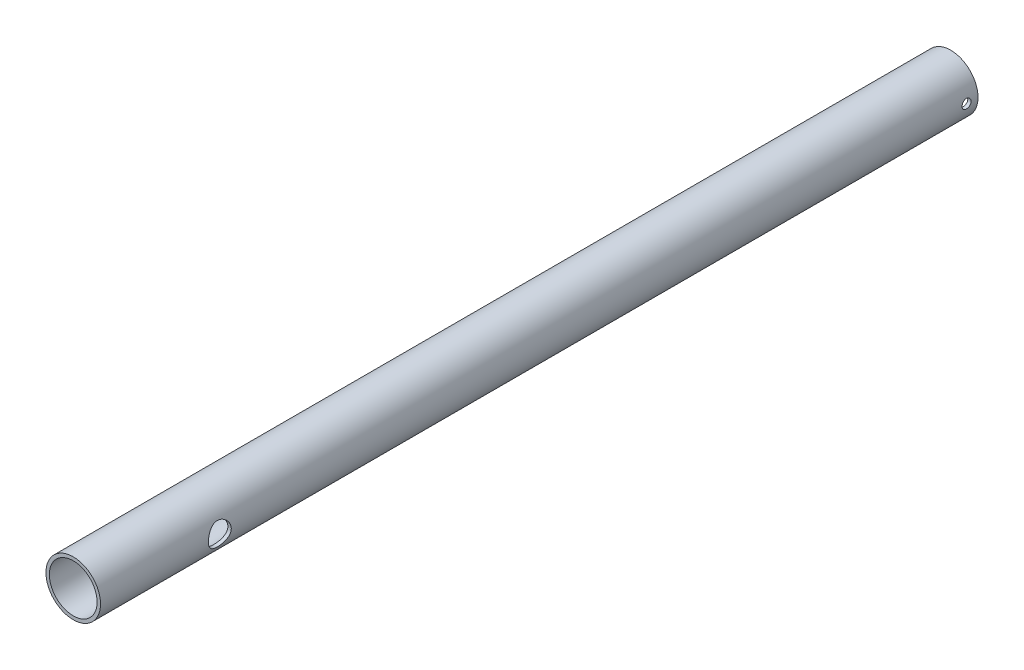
ISO-10303-21;
HEADER;
FILE_DESCRIPTION(('STEP AP214'),'2;1');
FILE_NAME('part.step','',(''),(''),'','','');
FILE_SCHEMA(('AUTOMOTIVE_DESIGN { 1 0 10303 214 1 1 1 1 }'));
ENDSEC;
DATA;
#1=APPLICATION_CONTEXT('core data for automotive mechanical design processes');
#2=APPLICATION_PROTOCOL_DEFINITION('international standard','automotive_design',2000,#1);
#3=PRODUCT_CONTEXT('',#1,'mechanical');
#4=PRODUCT('Part','Part','',(#3));
#5=PRODUCT_RELATED_PRODUCT_CATEGORY('part','',(#4));
#6=PRODUCT_DEFINITION_FORMATION('','',#4);
#7=PRODUCT_DEFINITION_CONTEXT('part definition',#1,'design');
#8=PRODUCT_DEFINITION('design','',#6,#7);
#9=PRODUCT_DEFINITION_SHAPE('','',#8);
#10=(LENGTH_UNIT() NAMED_UNIT(*) SI_UNIT(.MILLI.,.METRE.));
#11=(NAMED_UNIT(*) PLANE_ANGLE_UNIT() SI_UNIT($,.RADIAN.));
#12=(NAMED_UNIT(*) SI_UNIT($,.STERADIAN.) SOLID_ANGLE_UNIT());
#13=UNCERTAINTY_MEASURE_WITH_UNIT(LENGTH_MEASURE(1.E-05),#10,'distance_accuracy_value','');
#14=(GEOMETRIC_REPRESENTATION_CONTEXT(3) GLOBAL_UNCERTAINTY_ASSIGNED_CONTEXT((#13)) GLOBAL_UNIT_ASSIGNED_CONTEXT((#10,
#11,#12)) REPRESENTATION_CONTEXT('',''));
#15=CARTESIAN_POINT('',(0.,0.,0.));
#16=DIRECTION('',(0.,0.,1.));
#17=DIRECTION('',(1.,0.,0.));
#18=AXIS2_PLACEMENT_3D('',#15,#16,#17);
#19=CARTESIAN_POINT('',(0.,0.,772.));
#20=DIRECTION('',(0.,0.,1.));
#21=DIRECTION('',(1.,0.,0.));
#22=AXIS2_PLACEMENT_3D('',#19,#20,#21);
#23=PLANE('',#22);
#24=CARTESIAN_POINT('',(0.,0.,772.));
#25=DIRECTION('',(0.,0.,1.));
#26=DIRECTION('',(1.,0.,0.));
#27=AXIS2_PLACEMENT_3D('',#24,#25,#26);
#28=CIRCLE('',#27,24.);
#29=CARTESIAN_POINT('',(24.,0.,772.));
#30=VERTEX_POINT('',#29);
#31=EDGE_CURVE('E10',#30,#30,#28,.T.);
#32=ORIENTED_EDGE('',*,*,#31,.T.);
#33=EDGE_LOOP('',(#32));
#34=FACE_BOUND('',#33,.T.);
#35=CARTESIAN_POINT('',(0.,0.,772.));
#36=DIRECTION('',(0.,0.,1.));
#37=DIRECTION('',(1.,0.,0.));
#38=AXIS2_PLACEMENT_3D('',#35,#36,#37);
#39=CIRCLE('',#38,21.);
#40=CARTESIAN_POINT('',(21.,0.,772.));
#41=VERTEX_POINT('',#40);
#42=EDGE_CURVE('E47',#41,#41,#39,.T.);
#43=ORIENTED_EDGE('',*,*,#42,.F.);
#44=EDGE_LOOP('',(#43));
#45=FACE_BOUND('',#44,.T.);
#46=ADVANCED_FACE('F29',(#34,#45),#23,.T.);
#47=CARTESIAN_POINT('',(0.,0.,0.));
#48=DIRECTION('',(0.,0.,1.));
#49=DIRECTION('',(1.,0.,0.));
#50=AXIS2_PLACEMENT_3D('',#47,#48,#49);
#51=PLANE('',#50);
#52=CARTESIAN_POINT('',(0.,0.,0.));
#53=DIRECTION('',(0.,0.,1.));
#54=DIRECTION('',(1.,0.,0.));
#55=AXIS2_PLACEMENT_3D('',#52,#53,#54);
#56=CIRCLE('',#55,24.);
#57=CARTESIAN_POINT('',(24.,0.,0.));
#58=VERTEX_POINT('',#57);
#59=EDGE_CURVE('E42',#58,#58,#56,.T.);
#60=ORIENTED_EDGE('',*,*,#59,.F.);
#61=EDGE_LOOP('',(#60));
#62=FACE_BOUND('',#61,.T.);
#63=CARTESIAN_POINT('',(0.,0.,0.));
#64=DIRECTION('',(0.,0.,1.));
#65=DIRECTION('',(1.,0.,0.));
#66=AXIS2_PLACEMENT_3D('',#63,#64,#65);
#67=CIRCLE('',#66,21.);
#68=CARTESIAN_POINT('',(21.,0.,0.));
#69=VERTEX_POINT('',#68);
#70=EDGE_CURVE('E90',#69,#69,#67,.T.);
#71=ORIENTED_EDGE('',*,*,#70,.T.);
#72=EDGE_LOOP('',(#71));
#73=FACE_BOUND('',#72,.T.);
#74=ADVANCED_FACE('F98',(#62,#73),#51,.F.);
#75=CARTESIAN_POINT('',(0.,0.,772.));
#76=DIRECTION('',(0.,0.,-1.));
#77=DIRECTION('',(-1.,0.,0.));
#78=AXIS2_PLACEMENT_3D('',#75,#76,#77);
#79=CYLINDRICAL_SURFACE('',#78,24.);
#80=CARTESIAN_POINT('',(-24.,0.,14.));
#81=CARTESIAN_POINT('',(-23.9999961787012,-0.223025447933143,13.9999910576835));
#82=CARTESIAN_POINT('',(-23.9968588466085,-0.446172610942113,13.9812843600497));
#83=CARTESIAN_POINT('',(-23.9846455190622,-0.886208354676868,13.9069829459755));
#84=CARTESIAN_POINT('',(-23.9755640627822,-1.10309098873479,13.8513543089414));
#85=CARTESIAN_POINT('',(-23.9524810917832,-1.52416759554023,13.7049352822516));
#86=CARTESIAN_POINT('',(-23.9384836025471,-1.72837178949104,13.6141736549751));
#87=CARTESIAN_POINT('',(-23.9071076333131,-2.11862694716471,13.4001403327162));
#88=CARTESIAN_POINT('',(-23.8897295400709,-2.30467998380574,13.2768723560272));
#89=CARTESIAN_POINT('',(-23.853333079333,-2.65515618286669,13.0000718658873));
#90=CARTESIAN_POINT('',(-23.8343019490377,-2.81938064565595,12.8462894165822));
#91=CARTESIAN_POINT('',(-23.7968420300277,-3.11982159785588,12.5133632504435));
#92=CARTESIAN_POINT('',(-23.7784132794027,-3.25603631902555,12.3342179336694));
#93=CARTESIAN_POINT('',(-23.7441210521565,-3.49738740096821,11.9542864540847));
#94=CARTESIAN_POINT('',(-23.7282740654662,-3.6023272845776,11.7533738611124));
#95=CARTESIAN_POINT('',(-23.7011166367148,-3.77689338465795,11.336464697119));
#96=CARTESIAN_POINT('',(-23.6898058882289,-3.84652198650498,11.1204691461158));
#97=CARTESIAN_POINT('',(-23.6731285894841,-3.94786300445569,10.6816315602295));
#98=CARTESIAN_POINT('',(-23.6677082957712,-3.97991844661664,10.4588708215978));
#99=CARTESIAN_POINT('',(-23.6632630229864,-4.0062667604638,10.0110715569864));
#100=CARTESIAN_POINT('',(-23.6642375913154,-4.00056230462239,9.78603319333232));
#101=CARTESIAN_POINT('',(-23.6724228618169,-3.95183215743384,9.34251542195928));
#102=CARTESIAN_POINT('',(-23.6795691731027,-3.90919181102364,9.12399231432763));
#103=CARTESIAN_POINT('',(-23.6991919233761,-3.78840502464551,8.69724589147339));
#104=CARTESIAN_POINT('',(-23.7116685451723,-3.71025736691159,8.48902292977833));
#105=CARTESIAN_POINT('',(-23.7406156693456,-3.52028359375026,8.08763388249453));
#106=CARTESIAN_POINT('',(-23.7571050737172,-3.40829746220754,7.89454495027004));
#107=CARTESIAN_POINT('',(-23.7922066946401,-3.15393922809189,7.52975295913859));
#108=CARTESIAN_POINT('',(-23.8108190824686,-3.01156467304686,7.35805162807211));
#109=CARTESIAN_POINT('',(-23.8483524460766,-2.69837153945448,7.03867826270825));
#110=CARTESIAN_POINT('',(-23.8672743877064,-2.527222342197,6.89133037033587));
#111=CARTESIAN_POINT('',(-23.9030816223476,-2.16245639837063,6.62739557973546));
#112=CARTESIAN_POINT('',(-23.9199669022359,-1.96883950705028,6.51080887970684));
#113=CARTESIAN_POINT('',(-23.9498222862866,-1.56432946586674,6.31167643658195));
#114=CARTESIAN_POINT('',(-23.9627890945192,-1.35342196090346,6.22915932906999));
#115=CARTESIAN_POINT('',(-23.9833200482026,-0.92047735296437,6.10080925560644));
#116=CARTESIAN_POINT('',(-23.9908846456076,-0.698441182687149,6.05497322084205));
#117=CARTESIAN_POINT('',(-23.999698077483,-0.252335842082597,6.00172582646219));
#118=CARTESIAN_POINT('',(-24.0010200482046,-0.0283211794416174,5.99386948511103));
#119=CARTESIAN_POINT('',(-23.9973995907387,0.41782363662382,6.015618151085));
#120=CARTESIAN_POINT('',(-23.9924574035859,0.639953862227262,6.04522171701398));
#121=CARTESIAN_POINT('',(-23.9769092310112,1.07464988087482,6.14067975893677));
#122=CARTESIAN_POINT('',(-23.966337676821,1.28726538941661,6.2063139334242));
#123=CARTESIAN_POINT('',(-23.9407114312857,1.69847501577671,6.37173522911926));
#124=CARTESIAN_POINT('',(-23.9256564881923,1.89706834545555,6.47152426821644));
#125=CARTESIAN_POINT('',(-23.8925522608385,2.27652910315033,6.70344179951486));
#126=CARTESIAN_POINT('',(-23.8744776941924,2.45722440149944,6.83584824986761));
#127=CARTESIAN_POINT('',(-23.8374154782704,2.7939897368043,7.1288597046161));
#128=CARTESIAN_POINT('',(-23.8184277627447,2.95005798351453,7.28946675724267));
#129=CARTESIAN_POINT('',(-23.7814428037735,3.2347884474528,7.63631607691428));
#130=CARTESIAN_POINT('',(-23.7634578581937,3.36315001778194,7.82280666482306));
#131=CARTESIAN_POINT('',(-23.7307444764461,3.58672369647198,8.21496475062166));
#132=CARTESIAN_POINT('',(-23.7160159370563,3.68193685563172,8.42063164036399));
#133=CARTESIAN_POINT('',(-23.6915752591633,3.83606133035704,8.84446357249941));
#134=CARTESIAN_POINT('',(-23.681842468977,3.89512229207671,9.06257295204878));
#135=CARTESIAN_POINT('',(-23.6684434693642,3.97573672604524,9.50579220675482));
#136=CARTESIAN_POINT('',(-23.6647767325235,3.99729345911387,9.73090147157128));
#137=CARTESIAN_POINT('',(-23.6639477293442,4.00219658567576,10.1787282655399));
#138=CARTESIAN_POINT('',(-23.6667049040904,3.9860162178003,10.4014406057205));
#139=CARTESIAN_POINT('',(-23.6782365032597,3.91692774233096,10.8409267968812));
#140=CARTESIAN_POINT('',(-23.6870109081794,3.86401975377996,11.057700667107));
#141=CARTESIAN_POINT('',(-23.7095577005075,3.72315918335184,11.4789734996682));
#142=CARTESIAN_POINT('',(-23.7233242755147,3.63524734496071,11.6834864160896));
#143=CARTESIAN_POINT('',(-23.7543099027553,3.42692320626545,12.0749370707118));
#144=CARTESIAN_POINT('',(-23.7715291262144,3.3065092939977,12.2618739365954));
#145=CARTESIAN_POINT('',(-23.80773526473,3.03491021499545,12.6152569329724));
#146=CARTESIAN_POINT('',(-23.8267407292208,2.88337690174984,12.7814336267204));
#147=CARTESIAN_POINT('',(-23.8642299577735,2.55457445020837,13.0861625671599));
#148=CARTESIAN_POINT('',(-23.8827136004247,2.37729938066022,13.2247084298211));
#149=CARTESIAN_POINT('',(-23.9172244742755,2.00059067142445,13.4711172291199));
#150=CARTESIAN_POINT('',(-23.9332338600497,1.80101246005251,13.5787616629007));
#151=CARTESIAN_POINT('',(-23.9608186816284,1.38642091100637,13.7588311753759));
#152=CARTESIAN_POINT('',(-23.9723985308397,1.17142319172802,13.8312913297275));
#153=CARTESIAN_POINT('',(-23.9872926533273,0.796325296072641,13.9232084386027));
#154=CARTESIAN_POINT('',(-23.9920324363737,0.638494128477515,13.9519591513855));
#155=CARTESIAN_POINT('',(-23.9983874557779,0.320462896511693,13.9903579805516));
#156=CARTESIAN_POINT('',(-24.0000027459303,0.16026287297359,14.0000064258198));
#157=CARTESIAN_POINT('',(-24.,0.,14.));
#158=B_SPLINE_CURVE_WITH_KNOTS('',3,(#80,#81,#82,#83,#84,#85,#86,#87,#88,#89,#90,#91,#92,#93,
#94,#95,#96,#97,#98,#99,#100,#101,#102,#103,#104,#105,#106,#107,#108,#109,#110,#111,#112,#113,
#114,#115,#116,#117,#118,#119,#120,#121,#122,#123,#124,#125,#126,#127,#128,#129,#130,#131,#132,
#133,#134,#135,#136,#137,#138,#139,#140,#141,#142,#143,#144,#145,#146,#147,#148,#149,#150,#151,
#152,#153,#154,#155,#156,#157),.UNSPECIFIED.,.T.,.F.,(4,2,2,2,2,2,2,2,2,2,2,2,2,2,2,2,2,2,2,2,2,
2,2,2,2,2,2,2,2,2,2,2,2,2,2,2,2,2,4),(0.,0.668490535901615,1.33759607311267,2.00615498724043,
2.67463746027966,3.34883985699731,4.02308480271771,4.70148033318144,5.3798300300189,
6.05193723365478,6.72399686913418,7.38912834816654,8.05428264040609,8.72263290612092,
9.39103713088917,10.0677243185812,10.7444158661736,11.4216750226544,12.0988775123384,
12.7681261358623,13.4373490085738,14.1025249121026,14.7677381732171,15.4388292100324,
16.1099690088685,16.7880611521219,17.4661317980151,18.1413763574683,18.8165622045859,
19.4833265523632,20.1500887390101,20.8160770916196,21.4820984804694,22.1560221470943,
22.8301013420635,23.5088357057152,24.1868920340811,24.6672679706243,25.1476356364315),.UNSPECIFIED.);
#159=CARTESIAN_POINT('',(-24.,0.,14.));
#160=VERTEX_POINT('',#159);
#161=EDGE_CURVE('E58',#160,#160,#158,.T.);
#162=ORIENTED_EDGE('',*,*,#161,.T.);
#163=EDGE_LOOP('',(#162));
#164=FACE_BOUND('',#163,.T.);
#165=CARTESIAN_POINT('',(24.,0.,6.));
#166=CARTESIAN_POINT('',(23.9999961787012,-0.223025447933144,6.00000894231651));
#167=CARTESIAN_POINT('',(23.9968588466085,-0.446172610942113,6.01871563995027));
#168=CARTESIAN_POINT('',(23.9846455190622,-0.886208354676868,6.09301705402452));
#169=CARTESIAN_POINT('',(23.9755640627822,-1.10309098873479,6.14864569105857));
#170=CARTESIAN_POINT('',(23.9524810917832,-1.52416759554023,6.29506471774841));
#171=CARTESIAN_POINT('',(23.9384836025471,-1.72837178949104,6.38582634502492));
#172=CARTESIAN_POINT('',(23.9071076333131,-2.11862694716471,6.59985966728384));
#173=CARTESIAN_POINT('',(23.8897295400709,-2.30467998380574,6.7231276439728));
#174=CARTESIAN_POINT('',(23.853333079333,-2.65515618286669,6.99992813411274));
#175=CARTESIAN_POINT('',(23.8343019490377,-2.81938064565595,7.15371058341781));
#176=CARTESIAN_POINT('',(23.7968420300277,-3.11982159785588,7.4866367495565));
#177=CARTESIAN_POINT('',(23.7784132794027,-3.25603631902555,7.66578206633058));
#178=CARTESIAN_POINT('',(23.7441210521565,-3.49738740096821,8.04571354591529));
#179=CARTESIAN_POINT('',(23.7282740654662,-3.6023272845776,8.24662613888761));
#180=CARTESIAN_POINT('',(23.7011166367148,-3.77689338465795,8.663535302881));
#181=CARTESIAN_POINT('',(23.6898058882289,-3.84652198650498,8.87953085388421));
#182=CARTESIAN_POINT('',(23.6731285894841,-3.94786300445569,9.31836843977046));
#183=CARTESIAN_POINT('',(23.6677082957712,-3.97991844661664,9.54112917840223));
#184=CARTESIAN_POINT('',(23.6632630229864,-4.0062667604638,9.98892844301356));
#185=CARTESIAN_POINT('',(23.6642375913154,-4.00056230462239,10.2139668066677));
#186=CARTESIAN_POINT('',(23.6724228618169,-3.95183215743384,10.6574845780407));
#187=CARTESIAN_POINT('',(23.6795691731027,-3.90919181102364,10.8760076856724));
#188=CARTESIAN_POINT('',(23.6991919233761,-3.78840502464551,11.3027541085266));
#189=CARTESIAN_POINT('',(23.7116685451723,-3.71025736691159,11.5109770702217));
#190=CARTESIAN_POINT('',(23.7406156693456,-3.52028359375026,11.9123661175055));
#191=CARTESIAN_POINT('',(23.7571050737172,-3.40829746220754,12.10545504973));
#192=CARTESIAN_POINT('',(23.7922066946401,-3.15393922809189,12.4702470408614));
#193=CARTESIAN_POINT('',(23.8108190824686,-3.01156467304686,12.6419483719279));
#194=CARTESIAN_POINT('',(23.8483524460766,-2.69837153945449,12.9613217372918));
#195=CARTESIAN_POINT('',(23.8672743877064,-2.527222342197,13.1086696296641));
#196=CARTESIAN_POINT('',(23.9030816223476,-2.16245639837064,13.3726044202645));
#197=CARTESIAN_POINT('',(23.9199669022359,-1.96883950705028,13.4891911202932));
#198=CARTESIAN_POINT('',(23.9498222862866,-1.56432946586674,13.6883235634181));
#199=CARTESIAN_POINT('',(23.9627890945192,-1.35342196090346,13.77084067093));
#200=CARTESIAN_POINT('',(23.9833200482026,-0.92047735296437,13.8991907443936));
#201=CARTESIAN_POINT('',(23.9908846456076,-0.698441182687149,13.9450267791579));
#202=CARTESIAN_POINT('',(23.999698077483,-0.252335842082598,13.9982741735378));
#203=CARTESIAN_POINT('',(24.0010200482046,-0.0283211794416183,14.006130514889));
#204=CARTESIAN_POINT('',(23.9973995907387,0.41782363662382,13.984381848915));
#205=CARTESIAN_POINT('',(23.9924574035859,0.639953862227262,13.954778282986));
#206=CARTESIAN_POINT('',(23.9769092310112,1.07464988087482,13.8593202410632));
#207=CARTESIAN_POINT('',(23.966337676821,1.28726538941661,13.7936860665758));
#208=CARTESIAN_POINT('',(23.9407114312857,1.69847501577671,13.6282647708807));
#209=CARTESIAN_POINT('',(23.9256564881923,1.89706834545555,13.5284757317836));
#210=CARTESIAN_POINT('',(23.8925522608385,2.27652910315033,13.2965582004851));
#211=CARTESIAN_POINT('',(23.8744776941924,2.45722440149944,13.1641517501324));
#212=CARTESIAN_POINT('',(23.8374154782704,2.7939897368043,12.8711402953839));
#213=CARTESIAN_POINT('',(23.8184277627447,2.95005798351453,12.7105332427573));
#214=CARTESIAN_POINT('',(23.7814428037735,3.2347884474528,12.3636839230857));
#215=CARTESIAN_POINT('',(23.7634578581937,3.36315001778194,12.1771933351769));
#216=CARTESIAN_POINT('',(23.7307444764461,3.58672369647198,11.7850352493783));
#217=CARTESIAN_POINT('',(23.7160159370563,3.68193685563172,11.579368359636));
#218=CARTESIAN_POINT('',(23.6915752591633,3.83606133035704,11.1555364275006));
#219=CARTESIAN_POINT('',(23.681842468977,3.89512229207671,10.9374270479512));
#220=CARTESIAN_POINT('',(23.6684434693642,3.97573672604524,10.4942077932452));
#221=CARTESIAN_POINT('',(23.6647767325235,3.99729345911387,10.2690985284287));
#222=CARTESIAN_POINT('',(23.6639477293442,4.00219658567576,9.82127173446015));
#223=CARTESIAN_POINT('',(23.6667049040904,3.9860162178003,9.59855939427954));
#224=CARTESIAN_POINT('',(23.6782365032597,3.91692774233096,9.15907320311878));
#225=CARTESIAN_POINT('',(23.6870109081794,3.86401975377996,8.94229933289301));
#226=CARTESIAN_POINT('',(23.7095577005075,3.72315918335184,8.52102650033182));
#227=CARTESIAN_POINT('',(23.7233242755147,3.63524734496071,8.31651358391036));
#228=CARTESIAN_POINT('',(23.7543099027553,3.42692320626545,7.92506292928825));
#229=CARTESIAN_POINT('',(23.7715291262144,3.3065092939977,7.73812606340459));
#230=CARTESIAN_POINT('',(23.80773526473,3.03491021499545,7.3847430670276));
#231=CARTESIAN_POINT('',(23.8267407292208,2.88337690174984,7.21856637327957));
#232=CARTESIAN_POINT('',(23.8642299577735,2.55457445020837,6.91383743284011));
#233=CARTESIAN_POINT('',(23.8827136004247,2.37729938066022,6.77529157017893));
#234=CARTESIAN_POINT('',(23.9172244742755,2.00059067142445,6.52888277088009));
#235=CARTESIAN_POINT('',(23.9332338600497,1.80101246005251,6.42123833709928));
#236=CARTESIAN_POINT('',(23.9608186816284,1.38642091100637,6.24116882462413));
#237=CARTESIAN_POINT('',(23.9723985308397,1.17142319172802,6.16870867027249));
#238=CARTESIAN_POINT('',(23.9872926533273,0.796325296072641,6.07679156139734));
#239=CARTESIAN_POINT('',(23.9920324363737,0.638494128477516,6.04804084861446));
#240=CARTESIAN_POINT('',(23.9983874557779,0.320462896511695,6.0096420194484));
#241=CARTESIAN_POINT('',(24.0000027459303,0.160262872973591,5.99999357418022));
#242=CARTESIAN_POINT('',(24.,0.,6.));
#243=B_SPLINE_CURVE_WITH_KNOTS('',3,(#165,#166,#167,#168,#169,#170,#171,#172,#173,#174,#175,
#176,#177,#178,#179,#180,#181,#182,#183,#184,#185,#186,#187,#188,#189,#190,#191,#192,#193,#194,
#195,#196,#197,#198,#199,#200,#201,#202,#203,#204,#205,#206,#207,#208,#209,#210,#211,#212,#213,
#214,#215,#216,#217,#218,#219,#220,#221,#222,#223,#224,#225,#226,#227,#228,#229,#230,#231,#232,
#233,#234,#235,#236,#237,#238,#239,#240,#241,#242),.UNSPECIFIED.,.T.,.F.,(4,2,2,2,2,2,2,2,2,2,2,
2,2,2,2,2,2,2,2,2,2,2,2,2,2,2,2,2,2,2,2,2,2,2,2,2,2,2,4),(0.,0.668490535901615,1.33759607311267,
2.00615498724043,2.67463746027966,3.34883985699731,4.0230848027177,4.70148033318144,
5.3798300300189,6.05193723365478,6.72399686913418,7.38912834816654,8.05428264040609,
8.72263290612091,9.39103713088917,10.0677243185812,10.7444158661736,11.4216750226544,
12.0988775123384,12.7681261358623,13.4373490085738,14.1025249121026,14.7677381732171,
15.4388292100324,16.1099690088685,16.7880611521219,17.4661317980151,18.1413763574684,
18.8165622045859,19.4833265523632,20.1500887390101,20.8160770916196,21.4820984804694,
22.1560221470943,22.8301013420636,23.5088357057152,24.1868920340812,24.6672679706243,
25.1476356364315),.UNSPECIFIED.);
#244=CARTESIAN_POINT('',(24.,0.,6.));
#245=VERTEX_POINT('',#244);
#246=EDGE_CURVE('E136',#245,#245,#243,.T.);
#247=ORIENTED_EDGE('',*,*,#246,.T.);
#248=EDGE_LOOP('',(#247));
#249=FACE_BOUND('',#248,.T.);
#250=CARTESIAN_POINT('',(-24.,0.,677.05));
#251=CARTESIAN_POINT('',(-23.9999985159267,-0.269165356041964,677.049998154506));
#252=CARTESIAN_POINT('',(-23.9954595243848,-0.538420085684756,677.03917194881));
#253=CARTESIAN_POINT('',(-23.9774165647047,-1.07501098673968,676.995968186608));
#254=CARTESIAN_POINT('',(-23.9639069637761,-1.34234584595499,676.963577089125));
#255=CARTESIAN_POINT('',(-23.928239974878,-1.87359290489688,676.877484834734));
#256=CARTESIAN_POINT('',(-23.9060635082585,-2.13749621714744,676.823736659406));
#257=CARTESIAN_POINT('',(-23.8536456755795,-2.65939638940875,676.695480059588));
#258=CARTESIAN_POINT('',(-23.8234037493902,-2.9173928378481,676.620970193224));
#259=CARTESIAN_POINT('',(-23.7557512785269,-3.42484711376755,676.452204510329));
#260=CARTESIAN_POINT('',(-23.7183662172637,-3.67433168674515,676.358018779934));
#261=CARTESIAN_POINT('',(-23.6372869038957,-4.16417055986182,676.150570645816));
#262=CARTESIAN_POINT('',(-23.5935924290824,-4.40452453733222,676.037307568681));
#263=CARTESIAN_POINT('',(-23.5009697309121,-4.87460338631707,675.792661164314));
#264=CARTESIAN_POINT('',(-23.4520444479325,-5.10433412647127,675.66128800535));
#265=CARTESIAN_POINT('',(-23.3500918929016,-5.5521209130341,675.381304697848));
#266=CARTESIAN_POINT('',(-23.2970631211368,-5.77017264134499,675.232688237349));
#267=CARTESIAN_POINT('',(-23.1286444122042,-6.42449751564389,674.747997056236));
#268=CARTESIAN_POINT('',(-23.0083095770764,-6.83944262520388,674.384228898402));
#269=CARTESIAN_POINT('',(-22.7669425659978,-7.60445891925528,673.593743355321));
#270=CARTESIAN_POINT('',(-22.6459100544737,-7.95449562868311,673.166992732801));
#271=CARTESIAN_POINT('',(-22.4705712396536,-8.43233146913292,672.475602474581));
#272=CARTESIAN_POINT('',(-22.4118533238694,-8.58677268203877,672.230121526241));
#273=CARTESIAN_POINT('',(-22.2995747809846,-8.87427530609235,671.72587180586));
#274=CARTESIAN_POINT('',(-22.246012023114,-9.00734556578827,671.46710859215));
#275=CARTESIAN_POINT('',(-22.1458225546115,-9.25094085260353,670.937948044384));
#276=CARTESIAN_POINT('',(-22.0991945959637,-9.36146993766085,670.667552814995));
#277=CARTESIAN_POINT('',(-22.0145178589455,-9.55889933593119,670.116960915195));
#278=CARTESIAN_POINT('',(-21.9764684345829,-9.64580142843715,669.836764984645));
#279=CARTESIAN_POINT('',(-21.9119896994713,-9.79136034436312,669.282506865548));
#280=CARTESIAN_POINT('',(-21.8850865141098,-9.85118215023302,669.008805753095));
#281=CARTESIAN_POINT('',(-21.8413226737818,-9.94783650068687,668.456574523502));
#282=CARTESIAN_POINT('',(-21.8244617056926,-9.98466976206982,668.178044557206));
#283=CARTESIAN_POINT('',(-21.801423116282,-10.0348750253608,667.618570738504));
#284=CARTESIAN_POINT('',(-21.795240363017,-10.0482582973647,667.337628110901));
#285=CARTESIAN_POINT('',(-21.7937813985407,-10.0514228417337,666.775588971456));
#286=CARTESIAN_POINT('',(-21.7985046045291,-10.0412053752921,666.494492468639));
#287=CARTESIAN_POINT('',(-21.8178843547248,-9.99901971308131,665.956361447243));
#288=CARTESIAN_POINT('',(-21.8317386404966,-9.9688074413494,665.69915791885));
#289=CARTESIAN_POINT('',(-21.868118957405,-9.88874643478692,665.188358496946));
#290=CARTESIAN_POINT('',(-21.8906479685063,-9.83889095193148,664.934763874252));
#291=CARTESIAN_POINT('',(-21.9436698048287,-9.72006058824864,664.433021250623));
#292=CARTESIAN_POINT('',(-21.974160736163,-9.65109025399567,664.184871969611));
#293=CARTESIAN_POINT('',(-22.0422145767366,-9.49463261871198,663.695381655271));
#294=CARTESIAN_POINT('',(-22.079780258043,-9.40713805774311,663.454043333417));
#295=CARTESIAN_POINT('',(-22.1617664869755,-9.21235565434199,662.974663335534));
#296=CARTESIAN_POINT('',(-22.2063139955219,-9.10469203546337,662.736796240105));
#297=CARTESIAN_POINT('',(-22.3004549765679,-8.87161224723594,662.270846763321));
#298=CARTESIAN_POINT('',(-22.3500506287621,-8.74618840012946,662.042768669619));
#299=CARTESIAN_POINT('',(-22.4529819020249,-8.47845313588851,661.59761145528));
#300=CARTESIAN_POINT('',(-22.5063178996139,-8.33614001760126,661.380533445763));
#301=CARTESIAN_POINT('',(-22.6154070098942,-8.03547997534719,660.958417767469));
#302=CARTESIAN_POINT('',(-22.6711602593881,-7.87713214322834,660.753380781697));
#303=CARTESIAN_POINT('',(-22.788591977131,-7.53101993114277,660.339282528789));
#304=CARTESIAN_POINT('',(-22.8503687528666,-7.3418975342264,660.131382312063));
#305=CARTESIAN_POINT('',(-22.9735296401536,-6.94692103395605,659.732151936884));
#306=CARTESIAN_POINT('',(-23.0349138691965,-6.74107221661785,659.54081658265));
#307=CARTESIAN_POINT('',(-23.1557305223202,-6.31359632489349,659.175675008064));
#308=CARTESIAN_POINT('',(-23.2151616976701,-6.09195943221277,659.001879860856));
#309=CARTESIAN_POINT('',(-23.3304465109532,-5.63435100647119,658.673180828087));
#310=CARTESIAN_POINT('',(-23.3863015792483,-5.39838527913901,658.51826936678));
#311=CARTESIAN_POINT('',(-23.4942530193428,-4.90761466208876,658.224951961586));
#312=CARTESIAN_POINT('',(-23.5462280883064,-4.65249481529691,658.087027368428));
#313=CARTESIAN_POINT('',(-23.6434311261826,-4.1302190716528,657.833317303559));
#314=CARTESIAN_POINT('',(-23.6886589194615,-3.86306286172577,657.717532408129));
#315=CARTESIAN_POINT('',(-23.7710281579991,-3.31872679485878,657.509297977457));
#316=CARTESIAN_POINT('',(-23.8081732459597,-3.04155151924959,657.416837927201));
#317=CARTESIAN_POINT('',(-23.8732831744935,-2.47920147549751,657.25620456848));
#318=CARTESIAN_POINT('',(-23.9012487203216,-2.19402732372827,657.188029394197));
#319=CARTESIAN_POINT('',(-23.9456748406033,-1.63640903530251,657.080318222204));
#320=CARTESIAN_POINT('',(-23.9627553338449,-1.36431271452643,657.039233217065));
#321=CARTESIAN_POINT('',(-23.9876439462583,-0.817248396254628,656.979505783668));
#322=CARTESIAN_POINT('',(-23.9954524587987,-0.542280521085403,656.960862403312));
#323=CARTESIAN_POINT('',(-24.0015772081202,0.00829254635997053,656.946231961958));
#324=CARTESIAN_POINT('',(-23.9998958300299,0.283897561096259,656.950239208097));
#325=CARTESIAN_POINT('',(-23.9870934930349,0.8336245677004,656.98085089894));
#326=CARTESIAN_POINT('',(-23.9759727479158,1.10774659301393,657.007454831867));
#327=CARTESIAN_POINT('',(-23.9453951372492,1.63864851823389,657.081053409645));
#328=CARTESIAN_POINT('',(-23.926385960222,1.8956069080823,657.126954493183));
#329=CARTESIAN_POINT('',(-23.8806117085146,2.40450633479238,657.238407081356));
#330=CARTESIAN_POINT('',(-23.8538469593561,2.65644758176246,657.303957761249));
#331=CARTESIAN_POINT('',(-23.7932142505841,3.15367789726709,657.454097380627));
#332=CARTESIAN_POINT('',(-23.759346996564,3.3989676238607,657.538684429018));
#333=CARTESIAN_POINT('',(-23.6852967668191,3.88153910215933,657.726208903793));
#334=CARTESIAN_POINT('',(-23.645111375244,4.11881774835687,657.829153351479));
#335=CARTESIAN_POINT('',(-23.5580372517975,4.5911082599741,658.05601154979));
#336=CARTESIAN_POINT('',(-23.5109805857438,4.82582683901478,658.180472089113));
#337=CARTESIAN_POINT('',(-23.4122670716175,5.28401140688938,658.447102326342));
#338=CARTESIAN_POINT('',(-23.360608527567,5.50747319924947,658.589278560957));
#339=CARTESIAN_POINT('',(-23.2005291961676,6.15914461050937,659.040944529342));
#340=CARTESIAN_POINT('',(-23.0869527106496,6.56891081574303,659.375702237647));
#341=CARTESIAN_POINT('',(-22.8482275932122,7.35804440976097,660.131149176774));
#342=CARTESIAN_POINT('',(-22.7228352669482,7.73308544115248,660.556295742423));
#343=CARTESIAN_POINT('',(-22.5422667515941,8.23883564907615,661.237674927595));
#344=CARTESIAN_POINT('',(-22.4832936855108,8.39803785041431,661.472249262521));
#345=CARTESIAN_POINT('',(-22.3695660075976,8.69643427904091,661.954717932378));
#346=CARTESIAN_POINT('',(-22.3148096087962,8.83563700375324,662.202606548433));
#347=CARTESIAN_POINT('',(-22.2104015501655,9.09493958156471,662.714197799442));
#348=CARTESIAN_POINT('',(-22.1608416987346,9.21471151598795,662.978085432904));
#349=CARTESIAN_POINT('',(-22.0695155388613,9.43134701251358,663.51628325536));
#350=CARTESIAN_POINT('',(-22.0277456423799,9.52822112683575,663.79058857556));
#351=CARTESIAN_POINT('',(-21.9535085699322,9.6980441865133,664.347609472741));
#352=CARTESIAN_POINT('',(-21.9210371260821,9.77100411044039,664.630321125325));
#353=CARTESIAN_POINT('',(-21.8666279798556,9.89216919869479,665.201991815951));
#354=CARTESIAN_POINT('',(-21.8446892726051,9.94037672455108,665.490950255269));
#355=CARTESIAN_POINT('',(-21.8134872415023,10.0086491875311,666.050009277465));
#356=CARTESIAN_POINT('',(-21.8033721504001,10.0306082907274,666.319832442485));
#357=CARTESIAN_POINT('',(-21.7932075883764,10.0526741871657,666.860554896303));
#358=CARTESIAN_POINT('',(-21.7931575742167,10.0527821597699,667.131454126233));
#359=CARTESIAN_POINT('',(-21.8031241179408,10.0311473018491,667.672148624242));
#360=CARTESIAN_POINT('',(-21.8131392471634,10.0094075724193,667.941944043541));
#361=CARTESIAN_POINT('',(-21.8428789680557,9.94434078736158,668.478371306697));
#362=CARTESIAN_POINT('',(-21.8626034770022,9.9010139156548,668.745003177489));
#363=CARTESIAN_POINT('',(-21.9099200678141,9.79584350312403,669.260489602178));
#364=CARTESIAN_POINT('',(-21.9370911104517,9.73498382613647,669.509584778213));
#365=CARTESIAN_POINT('',(-21.9988120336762,9.59469322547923,670.00163877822));
#366=CARTESIAN_POINT('',(-22.0333644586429,9.51525589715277,670.244595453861));
#367=CARTESIAN_POINT('',(-22.1088568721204,9.33850489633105,670.722879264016));
#368=CARTESIAN_POINT('',(-22.1497968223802,9.24119133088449,670.958206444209));
#369=CARTESIAN_POINT('',(-22.2369644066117,9.0294251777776,671.420013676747));
#370=CARTESIAN_POINT('',(-22.2831925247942,8.91497102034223,671.64649291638));
#371=CARTESIAN_POINT('',(-22.3826797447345,8.66228465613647,672.102882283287));
#372=CARTESIAN_POINT('',(-22.4361949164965,8.52303348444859,672.332172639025));
#373=CARTESIAN_POINT('',(-22.5464048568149,8.2270625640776,672.778375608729));
#374=CARTESIAN_POINT('',(-22.6030997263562,8.07034226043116,672.995287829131));
#375=CARTESIAN_POINT('',(-22.7182322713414,7.7403144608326,673.415720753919));
#376=CARTESIAN_POINT('',(-22.7766704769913,7.56700188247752,673.619237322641));
#377=CARTESIAN_POINT('',(-22.8938307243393,7.20477255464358,674.01178171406));
#378=CARTESIAN_POINT('',(-22.9525527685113,7.01585566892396,674.200809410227));
#379=CARTESIAN_POINT('',(-23.0731882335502,6.60880556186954,674.576842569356));
#380=CARTESIAN_POINT('',(-23.1350151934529,6.38954460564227,674.762657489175));
#381=CARTESIAN_POINT('',(-23.2556524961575,5.93546863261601,675.115127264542));
#382=CARTESIAN_POINT('',(-23.314463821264,5.70065873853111,675.281788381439));
#383=CARTESIAN_POINT('',(-23.4275179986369,5.21662735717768,675.594907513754));
#384=CARTESIAN_POINT('',(-23.4817575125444,4.96739555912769,675.741350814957));
#385=CARTESIAN_POINT('',(-23.5840983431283,4.45625620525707,676.01265682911));
#386=CARTESIAN_POINT('',(-23.6322001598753,4.19434968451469,676.137521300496));
#387=CARTESIAN_POINT('',(-23.7201763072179,3.66392379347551,676.36268301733));
#388=CARTESIAN_POINT('',(-23.760170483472,3.39557844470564,676.463342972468));
#389=CARTESIAN_POINT('',(-23.8317356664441,2.85025769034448,676.641617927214));
#390=CARTESIAN_POINT('',(-23.8633075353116,2.57328317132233,676.71923528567));
#391=CARTESIAN_POINT('',(-23.9170293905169,2.01358980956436,676.850399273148));
#392=CARTESIAN_POINT('',(-23.9392043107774,1.73088828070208,676.90400962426));
#393=CARTESIAN_POINT('',(-23.9735731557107,1.16147331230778,676.986798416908));
#394=CARTESIAN_POINT('',(-23.9857743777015,0.874762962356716,677.015994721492));
#395=CARTESIAN_POINT('',(-23.9952064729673,0.489552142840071,677.038547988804));
#396=CARTESIAN_POINT('',(-23.9970030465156,0.391703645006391,677.042841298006));
#397=CARTESIAN_POINT('',(-23.9994000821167,0.195907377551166,677.04856764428));
#398=CARTESIAN_POINT('',(-24.0000005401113,0.0979596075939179,677.050000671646));
#399=CARTESIAN_POINT('',(-24.,0.,677.05));
#400=B_SPLINE_CURVE_WITH_KNOTS('',3,(#250,#251,#252,#253,#254,#255,#256,#257,#258,#259,#260,
#261,#262,#263,#264,#265,#266,#267,#268,#269,#270,#271,#272,#273,#274,#275,#276,#277,#278,#279,
#280,#281,#282,#283,#284,#285,#286,#287,#288,#289,#290,#291,#292,#293,#294,#295,#296,#297,#298,
#299,#300,#301,#302,#303,#304,#305,#306,#307,#308,#309,#310,#311,#312,#313,#314,#315,#316,#317,
#318,#319,#320,#321,#322,#323,#324,#325,#326,#327,#328,#329,#330,#331,#332,#333,#334,#335,#336,
#337,#338,#339,#340,#341,#342,#343,#344,#345,#346,#347,#348,#349,#350,#351,#352,#353,#354,#355,
#356,#357,#358,#359,#360,#361,#362,#363,#364,#365,#366,#367,#368,#369,#370,#371,#372,#373,#374,
#375,#376,#377,#378,#379,#380,#381,#382,#383,#384,#385,#386,#387,#388,#389,#390,#391,#392,#393,
#394,#395,#396,#397,#398,#399),.UNSPECIFIED.,.T.,.F.,(4,2,2,2,2,2,2,2,2,2,2,2,2,2,2,2,2,2,2,2,2,
2,2,2,2,2,2,2,2,2,2,2,2,2,2,2,2,2,2,2,2,2,2,2,2,2,2,2,2,2,2,2,2,2,2,2,2,2,2,2,2,2,2,2,2,2,2,2,2,
2,2,2,2,2,4),(0.,0.807396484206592,1.61530042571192,2.42499294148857,3.23474170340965,
4.04165384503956,4.84859447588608,5.65508386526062,6.46186940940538,8.14843422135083,
9.83589227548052,10.7226699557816,11.609079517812,12.4953293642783,13.3815124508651,
14.2247379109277,15.0679370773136,15.9107308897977,16.7534796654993,17.530594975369,
18.3079774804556,19.0851752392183,19.8626781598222,20.6564460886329,21.4505582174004,
22.2447504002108,23.0389875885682,23.9012919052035,24.763324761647,25.625898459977,
26.4881249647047,27.3709003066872,28.2536986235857,29.1360982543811,30.0184300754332,
30.8444987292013,31.670532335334,32.4963583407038,33.3221656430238,34.1064134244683,
34.8906282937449,35.674765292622,36.459202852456,37.267725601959,38.0765475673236,
39.6932869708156,41.4266740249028,42.2945282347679,43.1620126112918,44.0428829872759,
44.9233466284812,45.8034054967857,46.6833803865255,47.4950438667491,48.3066635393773,
49.1181680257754,49.9296655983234,50.7023817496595,51.4753646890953,52.2483429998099,
53.0213921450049,53.841158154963,54.6609502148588,55.4809941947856,56.3010453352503,
57.1819381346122,58.0625421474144,58.9437837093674,59.8249534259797,60.6919558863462,
61.5588695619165,62.4234683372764,63.2874339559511,63.5812755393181,63.8751181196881),.UNSPECIFIED.);
#401=CARTESIAN_POINT('',(-24.,0.,677.05));
#402=VERTEX_POINT('',#401);
#403=EDGE_CURVE('E82',#402,#402,#400,.T.);
#404=ORIENTED_EDGE('',*,*,#403,.T.);
#405=EDGE_LOOP('',(#404));
#406=FACE_BOUND('',#405,.T.);
#407=CARTESIAN_POINT('',(24.,0.,656.95));
#408=CARTESIAN_POINT('',(23.9999985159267,-0.26916535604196,656.950001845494));
#409=CARTESIAN_POINT('',(23.9954595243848,-0.538420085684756,656.96082805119));
#410=CARTESIAN_POINT('',(23.9774165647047,-1.07501098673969,657.004031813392));
#411=CARTESIAN_POINT('',(23.9639069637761,-1.34234584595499,657.036422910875));
#412=CARTESIAN_POINT('',(23.928239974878,-1.87359290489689,657.122515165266));
#413=CARTESIAN_POINT('',(23.9060635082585,-2.13749621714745,657.176263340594));
#414=CARTESIAN_POINT('',(23.8536456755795,-2.65939638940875,657.304519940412));
#415=CARTESIAN_POINT('',(23.8234037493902,-2.91739283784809,657.379029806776));
#416=CARTESIAN_POINT('',(23.7557512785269,-3.42484711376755,657.547795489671));
#417=CARTESIAN_POINT('',(23.7183662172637,-3.67433168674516,657.641981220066));
#418=CARTESIAN_POINT('',(23.6372869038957,-4.16417055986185,657.849429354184));
#419=CARTESIAN_POINT('',(23.5935924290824,-4.40452453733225,657.962692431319));
#420=CARTESIAN_POINT('',(23.500969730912,-4.87460338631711,658.207338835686));
#421=CARTESIAN_POINT('',(23.4520444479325,-5.10433412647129,658.33871199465));
#422=CARTESIAN_POINT('',(23.3500918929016,-5.5521209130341,658.618695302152));
#423=CARTESIAN_POINT('',(23.2970631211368,-5.770172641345,658.767311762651));
#424=CARTESIAN_POINT('',(23.1286444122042,-6.42449751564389,659.252002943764));
#425=CARTESIAN_POINT('',(23.0083095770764,-6.83944262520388,659.615771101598));
#426=CARTESIAN_POINT('',(22.7669425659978,-7.60445891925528,660.406256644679));
#427=CARTESIAN_POINT('',(22.6459100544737,-7.95449562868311,660.833007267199));
#428=CARTESIAN_POINT('',(22.4705712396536,-8.43233146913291,661.524397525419));
#429=CARTESIAN_POINT('',(22.4118533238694,-8.58677268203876,661.769878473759));
#430=CARTESIAN_POINT('',(22.2995747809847,-8.87427530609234,662.27412819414));
#431=CARTESIAN_POINT('',(22.246012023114,-9.00734556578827,662.53289140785));
#432=CARTESIAN_POINT('',(22.1458225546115,-9.25094085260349,663.062051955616));
#433=CARTESIAN_POINT('',(22.0991945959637,-9.3614699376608,663.332447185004));
#434=CARTESIAN_POINT('',(22.0145178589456,-9.55889933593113,663.883039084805));
#435=CARTESIAN_POINT('',(21.9764684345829,-9.64580142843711,664.163235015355));
#436=CARTESIAN_POINT('',(21.9119896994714,-9.79136034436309,664.717493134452));
#437=CARTESIAN_POINT('',(21.8850865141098,-9.85118215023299,664.991194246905));
#438=CARTESIAN_POINT('',(21.8413226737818,-9.94783650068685,665.543425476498));
#439=CARTESIAN_POINT('',(21.8244617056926,-9.9846697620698,665.821955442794));
#440=CARTESIAN_POINT('',(21.801423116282,-10.0348750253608,666.381429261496));
#441=CARTESIAN_POINT('',(21.795240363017,-10.0482582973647,666.662371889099));
#442=CARTESIAN_POINT('',(21.7937813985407,-10.0514228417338,667.224411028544));
#443=CARTESIAN_POINT('',(21.7985046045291,-10.0412053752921,667.505507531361));
#444=CARTESIAN_POINT('',(21.8178843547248,-9.99901971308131,668.043638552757));
#445=CARTESIAN_POINT('',(21.8317386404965,-9.96880744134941,668.30084208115));
#446=CARTESIAN_POINT('',(21.868118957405,-9.88874643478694,668.811641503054));
#447=CARTESIAN_POINT('',(21.8906479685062,-9.8388909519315,669.065236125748));
#448=CARTESIAN_POINT('',(21.9436698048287,-9.72006058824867,669.566978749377));
#449=CARTESIAN_POINT('',(21.974160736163,-9.65109025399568,669.815128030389));
#450=CARTESIAN_POINT('',(22.0422145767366,-9.49463261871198,670.304618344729));
#451=CARTESIAN_POINT('',(22.079780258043,-9.40713805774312,670.545956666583));
#452=CARTESIAN_POINT('',(22.1617664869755,-9.21235565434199,671.025336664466));
#453=CARTESIAN_POINT('',(22.2063139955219,-9.10469203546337,671.263203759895));
#454=CARTESIAN_POINT('',(22.3004549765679,-8.87161224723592,671.729153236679));
#455=CARTESIAN_POINT('',(22.3500506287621,-8.74618840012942,671.957231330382));
#456=CARTESIAN_POINT('',(22.4529819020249,-8.47845313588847,672.40238854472));
#457=CARTESIAN_POINT('',(22.5063178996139,-8.33614001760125,672.619466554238));
#458=CARTESIAN_POINT('',(22.6154070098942,-8.03547997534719,673.041582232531));
#459=CARTESIAN_POINT('',(22.6711602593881,-7.87713214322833,673.246619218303));
#460=CARTESIAN_POINT('',(22.788591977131,-7.53101993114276,673.660717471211));
#461=CARTESIAN_POINT('',(22.8503687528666,-7.3418975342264,673.868617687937));
#462=CARTESIAN_POINT('',(22.9735296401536,-6.94692103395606,674.267848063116));
#463=CARTESIAN_POINT('',(23.0349138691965,-6.74107221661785,674.45918341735));
#464=CARTESIAN_POINT('',(23.1557305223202,-6.31359632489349,674.824324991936));
#465=CARTESIAN_POINT('',(23.2151616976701,-6.09195943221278,674.998120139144));
#466=CARTESIAN_POINT('',(23.3304465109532,-5.6343510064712,675.326819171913));
#467=CARTESIAN_POINT('',(23.3863015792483,-5.39838527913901,675.48173063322));
#468=CARTESIAN_POINT('',(23.4942530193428,-4.90761466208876,675.775048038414));
#469=CARTESIAN_POINT('',(23.5462280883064,-4.65249481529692,675.912972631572));
#470=CARTESIAN_POINT('',(23.6434311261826,-4.13021907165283,676.166682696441));
#471=CARTESIAN_POINT('',(23.6886589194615,-3.8630628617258,676.282467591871));
#472=CARTESIAN_POINT('',(23.7710281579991,-3.31872679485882,676.490702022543));
#473=CARTESIAN_POINT('',(23.8081732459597,-3.04155151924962,676.583162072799));
#474=CARTESIAN_POINT('',(23.8732831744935,-2.47920147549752,676.743795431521));
#475=CARTESIAN_POINT('',(23.9012487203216,-2.19402732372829,676.811970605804));
#476=CARTESIAN_POINT('',(23.9456748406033,-1.63640903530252,676.919681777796));
#477=CARTESIAN_POINT('',(23.9627553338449,-1.36431271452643,676.960766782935));
#478=CARTESIAN_POINT('',(23.9876439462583,-0.817248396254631,677.020494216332));
#479=CARTESIAN_POINT('',(23.9954524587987,-0.542280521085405,677.039137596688));
#480=CARTESIAN_POINT('',(24.0015772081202,0.00829254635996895,677.053768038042));
#481=CARTESIAN_POINT('',(23.9998958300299,0.283897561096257,677.049760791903));
#482=CARTESIAN_POINT('',(23.9870934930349,0.833624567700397,677.01914910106));
#483=CARTESIAN_POINT('',(23.9759727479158,1.10774659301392,676.992545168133));
#484=CARTESIAN_POINT('',(23.9453951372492,1.63864851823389,676.918946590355));
#485=CARTESIAN_POINT('',(23.926385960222,1.89560690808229,676.873045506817));
#486=CARTESIAN_POINT('',(23.8806117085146,2.40450633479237,676.761592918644));
#487=CARTESIAN_POINT('',(23.8538469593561,2.65644758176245,676.696042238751));
#488=CARTESIAN_POINT('',(23.7932142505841,3.15367789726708,676.545902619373));
#489=CARTESIAN_POINT('',(23.759346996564,3.39896762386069,676.461315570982));
#490=CARTESIAN_POINT('',(23.6852967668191,3.88153910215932,676.273791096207));
#491=CARTESIAN_POINT('',(23.645111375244,4.11881774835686,676.170846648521));
#492=CARTESIAN_POINT('',(23.5580372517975,4.59110825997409,675.94398845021));
#493=CARTESIAN_POINT('',(23.5109805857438,4.82582683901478,675.819527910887));
#494=CARTESIAN_POINT('',(23.4122670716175,5.2840114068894,675.552897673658));
#495=CARTESIAN_POINT('',(23.360608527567,5.50747319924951,675.410721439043));
#496=CARTESIAN_POINT('',(23.2005291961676,6.15914461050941,674.959055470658));
#497=CARTESIAN_POINT('',(23.0869527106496,6.56891081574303,674.624297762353));
#498=CARTESIAN_POINT('',(22.8482275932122,7.35804440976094,673.868850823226));
#499=CARTESIAN_POINT('',(22.7228352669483,7.73308544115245,673.443704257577));
#500=CARTESIAN_POINT('',(22.5422667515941,8.2388356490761,672.762325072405));
#501=CARTESIAN_POINT('',(22.4832936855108,8.39803785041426,672.527750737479));
#502=CARTESIAN_POINT('',(22.3695660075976,8.69643427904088,672.045282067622));
#503=CARTESIAN_POINT('',(22.3148096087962,8.83563700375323,671.797393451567));
#504=CARTESIAN_POINT('',(22.2104015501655,9.09493958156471,671.285802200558));
#505=CARTESIAN_POINT('',(22.1608416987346,9.21471151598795,671.021914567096));
#506=CARTESIAN_POINT('',(22.0695155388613,9.43134701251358,670.48371674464));
#507=CARTESIAN_POINT('',(22.0277456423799,9.52822112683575,670.20941142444));
#508=CARTESIAN_POINT('',(21.9535085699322,9.6980441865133,669.652390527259));
#509=CARTESIAN_POINT('',(21.9210371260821,9.77100411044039,669.369678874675));
#510=CARTESIAN_POINT('',(21.8666279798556,9.89216919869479,668.798008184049));
#511=CARTESIAN_POINT('',(21.8446892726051,9.94037672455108,668.509049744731));
#512=CARTESIAN_POINT('',(21.8134872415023,10.0086491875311,667.949990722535));
#513=CARTESIAN_POINT('',(21.8033721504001,10.0306082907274,667.680167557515));
#514=CARTESIAN_POINT('',(21.7932075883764,10.0526741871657,667.139445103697));
#515=CARTESIAN_POINT('',(21.7931575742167,10.0527821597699,666.868545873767));
#516=CARTESIAN_POINT('',(21.8031241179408,10.0311473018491,666.327851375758));
#517=CARTESIAN_POINT('',(21.8131392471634,10.0094075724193,666.05805595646));
#518=CARTESIAN_POINT('',(21.8428789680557,9.9443407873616,665.521628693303));
#519=CARTESIAN_POINT('',(21.8626034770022,9.90101391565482,665.254996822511));
#520=CARTESIAN_POINT('',(21.9099200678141,9.79584350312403,664.739510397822));
#521=CARTESIAN_POINT('',(21.9370911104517,9.73498382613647,664.490415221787));
#522=CARTESIAN_POINT('',(21.9988120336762,9.59469322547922,663.99836122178));
#523=CARTESIAN_POINT('',(22.0333644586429,9.51525589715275,663.755404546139));
#524=CARTESIAN_POINT('',(22.1088568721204,9.33850489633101,663.277120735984));
#525=CARTESIAN_POINT('',(22.1497968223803,9.24119133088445,663.041793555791));
#526=CARTESIAN_POINT('',(22.2369644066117,9.02942517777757,662.579986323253));
#527=CARTESIAN_POINT('',(22.2831925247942,8.91497102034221,662.35350708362));
#528=CARTESIAN_POINT('',(22.3826797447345,8.66228465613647,661.897117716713));
#529=CARTESIAN_POINT('',(22.4361949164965,8.52303348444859,661.667827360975));
#530=CARTESIAN_POINT('',(22.5464048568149,8.2270625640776,661.221624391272));
#531=CARTESIAN_POINT('',(22.6030997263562,8.07034226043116,661.004712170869));
#532=CARTESIAN_POINT('',(22.7182322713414,7.7403144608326,660.584279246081));
#533=CARTESIAN_POINT('',(22.7766704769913,7.56700188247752,660.380762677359));
#534=CARTESIAN_POINT('',(22.8938307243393,7.20477255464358,659.98821828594));
#535=CARTESIAN_POINT('',(22.9525527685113,7.01585566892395,659.799190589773));
#536=CARTESIAN_POINT('',(23.0731882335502,6.60880556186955,659.423157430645));
#537=CARTESIAN_POINT('',(23.1350151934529,6.38954460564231,659.237342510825));
#538=CARTESIAN_POINT('',(23.2556524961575,5.93546863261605,658.884872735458));
#539=CARTESIAN_POINT('',(23.314463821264,5.70065873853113,658.718211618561));
#540=CARTESIAN_POINT('',(23.4275179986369,5.21662735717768,658.405092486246));
#541=CARTESIAN_POINT('',(23.4817575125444,4.96739555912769,658.258649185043));
#542=CARTESIAN_POINT('',(23.5840983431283,4.45625620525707,657.98734317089));
#543=CARTESIAN_POINT('',(23.6322001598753,4.19434968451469,657.862478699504));
#544=CARTESIAN_POINT('',(23.7201763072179,3.6639237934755,657.63731698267));
#545=CARTESIAN_POINT('',(23.760170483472,3.39557844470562,657.536657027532));
#546=CARTESIAN_POINT('',(23.8317356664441,2.85025769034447,657.358382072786));
#547=CARTESIAN_POINT('',(23.8633075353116,2.57328317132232,657.280764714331));
#548=CARTESIAN_POINT('',(23.9170293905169,2.01358980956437,657.149600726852));
#549=CARTESIAN_POINT('',(23.9392043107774,1.73088828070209,657.09599037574));
#550=CARTESIAN_POINT('',(23.9735731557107,1.16147331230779,657.013201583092));
#551=CARTESIAN_POINT('',(23.9857743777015,0.874762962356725,656.984005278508));
#552=CARTESIAN_POINT('',(23.9952064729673,0.489552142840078,656.961452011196));
#553=CARTESIAN_POINT('',(23.9970030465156,0.391703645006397,656.957158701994));
#554=CARTESIAN_POINT('',(23.9994000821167,0.195907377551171,656.95143235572));
#555=CARTESIAN_POINT('',(24.0000005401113,0.0979596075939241,656.949999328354));
#556=CARTESIAN_POINT('',(24.,0.,656.95));
#557=B_SPLINE_CURVE_WITH_KNOTS('',3,(#407,#408,#409,#410,#411,#412,#413,#414,#415,#416,#417,
#418,#419,#420,#421,#422,#423,#424,#425,#426,#427,#428,#429,#430,#431,#432,#433,#434,#435,#436,
#437,#438,#439,#440,#441,#442,#443,#444,#445,#446,#447,#448,#449,#450,#451,#452,#453,#454,#455,
#456,#457,#458,#459,#460,#461,#462,#463,#464,#465,#466,#467,#468,#469,#470,#471,#472,#473,#474,
#475,#476,#477,#478,#479,#480,#481,#482,#483,#484,#485,#486,#487,#488,#489,#490,#491,#492,#493,
#494,#495,#496,#497,#498,#499,#500,#501,#502,#503,#504,#505,#506,#507,#508,#509,#510,#511,#512,
#513,#514,#515,#516,#517,#518,#519,#520,#521,#522,#523,#524,#525,#526,#527,#528,#529,#530,#531,
#532,#533,#534,#535,#536,#537,#538,#539,#540,#541,#542,#543,#544,#545,#546,#547,#548,#549,#550,
#551,#552,#553,#554,#555,#556),.UNSPECIFIED.,.T.,.F.,(4,2,2,2,2,2,2,2,2,2,2,2,2,2,2,2,2,2,2,2,2,
2,2,2,2,2,2,2,2,2,2,2,2,2,2,2,2,2,2,2,2,2,2,2,2,2,2,2,2,2,2,2,2,2,2,2,2,2,2,2,2,2,2,2,2,2,2,2,2,
2,2,2,2,2,4),(0.,0.807396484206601,1.61530042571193,2.42499294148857,3.23474170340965,
4.04165384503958,4.84859447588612,5.65508386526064,6.46186940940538,8.14843422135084,
9.83589227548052,10.7226699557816,11.609079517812,12.495329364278,13.381512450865,
14.2247379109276,15.0679370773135,15.9107308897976,16.7534796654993,17.5305949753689,
18.3079774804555,19.0851752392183,19.8626781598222,20.6564460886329,21.4505582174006,
22.2447504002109,23.0389875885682,23.9012919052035,24.763324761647,25.625898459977,
26.4881249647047,27.3709003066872,28.2536986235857,29.1360982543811,30.0184300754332,
30.8444987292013,31.670532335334,32.4963583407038,33.3221656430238,34.1064134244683,
34.8906282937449,35.674765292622,36.459202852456,37.267725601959,38.0765475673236,
39.6932869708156,41.4266740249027,42.2945282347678,43.1620126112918,44.0428829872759,
44.9233466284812,45.8034054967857,46.6833803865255,47.4950438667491,48.3066635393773,
49.1181680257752,49.9296655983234,50.7023817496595,51.4753646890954,52.24834299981,
53.021392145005,53.8411581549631,54.6609502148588,55.4809941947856,56.3010453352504,
57.1819381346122,58.0625421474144,58.9437837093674,59.8249534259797,60.6919558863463,
61.5588695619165,62.4234683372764,63.2874339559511,63.5812755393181,63.8751181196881),.UNSPECIFIED.);
#558=CARTESIAN_POINT('',(24.,0.,656.95));
#559=VERTEX_POINT('',#558);
#560=EDGE_CURVE('E77',#559,#559,#557,.T.);
#561=ORIENTED_EDGE('',*,*,#560,.T.);
#562=EDGE_LOOP('',(#561));
#563=FACE_BOUND('',#562,.T.);
#564=ORIENTED_EDGE('',*,*,#31,.F.);
#565=EDGE_LOOP('',(#564));
#566=FACE_BOUND('',#565,.T.);
#567=ORIENTED_EDGE('',*,*,#59,.T.);
#568=EDGE_LOOP('',(#567));
#569=FACE_BOUND('',#568,.T.);
#570=ADVANCED_FACE('F31',(#164,#249,#406,#563,#566,#569),#79,.T.);
#571=CARTESIAN_POINT('',(0.,0.,772.));
#572=DIRECTION('',(0.,0.,-1.));
#573=DIRECTION('',(-1.,0.,0.));
#574=AXIS2_PLACEMENT_3D('',#571,#572,#573);
#575=CYLINDRICAL_SURFACE('',#574,21.);
#576=CARTESIAN_POINT('',(-21.,0.,14.));
#577=CARTESIAN_POINT('',(-20.9999959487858,-0.222525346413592,13.9999915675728));
#578=CARTESIAN_POINT('',(-20.9964265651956,-0.445159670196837,13.9813681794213));
#579=CARTESIAN_POINT('',(-20.9825316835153,-0.88415013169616,13.9074172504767));
#580=CARTESIAN_POINT('',(-20.972200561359,-1.10050088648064,13.8520591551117));
#581=CARTESIAN_POINT('',(-20.9459373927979,-1.52051236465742,13.7063989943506));
#582=CARTESIAN_POINT('',(-20.9300104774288,-1.72418451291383,13.6161289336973));
#583=CARTESIAN_POINT('',(-20.8942931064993,-2.11347489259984,13.403299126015));
#584=CARTESIAN_POINT('',(-20.8745029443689,-2.29909449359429,13.2807418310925));
#585=CARTESIAN_POINT('',(-20.8329689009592,-2.64931909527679,13.0052114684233));
#586=CARTESIAN_POINT('',(-20.8112058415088,-2.81366912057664,12.8519171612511));
#587=CARTESIAN_POINT('',(-20.7683205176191,-3.11448301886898,12.5199551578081));
#588=CARTESIAN_POINT('',(-20.7471983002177,-3.25094484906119,12.3412856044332));
#589=CARTESIAN_POINT('',(-20.7077995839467,-3.4931749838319,11.9618354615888));
#590=CARTESIAN_POINT('',(-20.689547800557,-3.59868283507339,11.7608858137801));
#591=CARTESIAN_POINT('',(-20.6582272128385,-3.77434242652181,11.3437073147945));
#592=CARTESIAN_POINT('',(-20.6451579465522,-3.84449731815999,11.127479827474));
#593=CARTESIAN_POINT('',(-20.6258754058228,-3.94663904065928,10.6886153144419));
#594=CARTESIAN_POINT('',(-20.6195822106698,-3.97907116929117,10.4660855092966));
#595=CARTESIAN_POINT('',(-20.6143234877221,-4.00622913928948,10.018660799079));
#596=CARTESIAN_POINT('',(-20.6153572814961,-4.00095847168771,9.79376611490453));
#597=CARTESIAN_POINT('',(-20.6245630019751,-3.95322129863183,9.35122907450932));
#598=CARTESIAN_POINT('',(-20.6326375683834,-3.91126210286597,9.1335296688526));
#599=CARTESIAN_POINT('',(-20.6548620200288,-3.79213830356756,8.70831783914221));
#600=CARTESIAN_POINT('',(-20.6690121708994,-3.71497216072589,8.50080586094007));
#601=CARTESIAN_POINT('',(-20.7018946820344,-3.52713153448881,8.10038023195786));
#602=CARTESIAN_POINT('',(-20.7206547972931,-3.41625308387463,7.90756463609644));
#603=CARTESIAN_POINT('',(-20.7606252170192,-3.1642794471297,7.54308468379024));
#604=CARTESIAN_POINT('',(-20.7818357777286,-3.02318109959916,7.371422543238));
#605=CARTESIAN_POINT('',(-20.8247408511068,-2.71204215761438,7.05119213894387));
#606=CARTESIAN_POINT('',(-20.8464376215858,-2.54156786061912,6.90304524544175));
#607=CARTESIAN_POINT('',(-20.8875534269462,-2.17796507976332,6.63738752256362));
#608=CARTESIAN_POINT('',(-20.9069724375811,-1.98483635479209,6.51987701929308));
#609=CARTESIAN_POINT('',(-20.9413858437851,-1.58096076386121,6.3187620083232));
#610=CARTESIAN_POINT('',(-20.9563743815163,-1.37019104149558,6.23520233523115));
#611=CARTESIAN_POINT('',(-20.9801929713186,-0.937257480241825,6.10479235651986));
#612=CARTESIAN_POINT('',(-20.9890236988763,-0.715094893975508,6.05793802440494));
#613=CARTESIAN_POINT('',(-20.9994386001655,-0.269306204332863,6.00285759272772));
#614=CARTESIAN_POINT('',(-21.0011310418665,-0.0457538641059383,5.99405431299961));
#615=CARTESIAN_POINT('',(-20.997378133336,0.399628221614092,6.01377621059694));
#616=CARTESIAN_POINT('',(-20.9919331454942,0.621458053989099,6.04229949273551));
#617=CARTESIAN_POINT('',(-20.9745846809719,1.05526017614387,6.13538505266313));
#618=CARTESIAN_POINT('',(-20.962733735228,1.26729762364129,6.19965432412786));
#619=CARTESIAN_POINT('',(-20.9338968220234,1.67758742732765,6.36208969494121));
#620=CARTESIAN_POINT('',(-20.9169104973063,1.87583882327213,6.46025815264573));
#621=CARTESIAN_POINT('',(-20.879416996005,2.25538540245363,6.68897601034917));
#622=CARTESIAN_POINT('',(-20.8588724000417,2.43646501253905,6.81987688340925));
#623=CARTESIAN_POINT('',(-20.8166357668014,2.7742949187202,7.10986933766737));
#624=CARTESIAN_POINT('',(-20.7949436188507,2.93104286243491,7.26896364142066));
#625=CARTESIAN_POINT('',(-20.752496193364,3.21796115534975,7.61344329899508));
#626=CARTESIAN_POINT('',(-20.7317578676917,3.34773705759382,7.79915962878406));
#627=CARTESIAN_POINT('',(-20.693911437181,3.57425129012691,8.19009513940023));
#628=CARTESIAN_POINT('',(-20.6768031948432,3.67099087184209,8.39531358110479));
#629=CARTESIAN_POINT('',(-20.6482879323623,3.82813194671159,8.81844194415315));
#630=CARTESIAN_POINT('',(-20.636852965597,3.88871186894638,9.0362836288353));
#631=CARTESIAN_POINT('',(-20.6209161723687,3.97236222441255,9.47929254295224));
#632=CARTESIAN_POINT('',(-20.6164135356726,3.99543704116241,9.70445891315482));
#633=CARTESIAN_POINT('',(-20.6148932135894,4.0032718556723,10.1517723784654));
#634=CARTESIAN_POINT('',(-20.6177539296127,3.98865429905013,10.3739083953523));
#635=CARTESIAN_POINT('',(-20.6303678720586,3.92288461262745,10.8124945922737));
#636=CARTESIAN_POINT('',(-20.640121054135,3.87173271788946,11.0289448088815));
#637=CARTESIAN_POINT('',(-20.6653690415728,3.73461253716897,11.4496660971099));
#638=CARTESIAN_POINT('',(-20.6808523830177,3.64871373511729,11.6539605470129));
#639=CARTESIAN_POINT('',(-20.7158238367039,3.44460692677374,12.0453369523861));
#640=CARTESIAN_POINT('',(-20.735312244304,3.3263965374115,12.2324176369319));
#641=CARTESIAN_POINT('',(-20.7764741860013,3.05886697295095,12.5871696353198));
#642=CARTESIAN_POINT('',(-20.7981768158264,2.90909560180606,12.75449661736));
#643=CARTESIAN_POINT('',(-20.8411062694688,2.58363633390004,13.0618506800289));
#644=CARTESIAN_POINT('',(-20.8623329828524,2.40794249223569,13.2018714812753));
#645=CARTESIAN_POINT('',(-20.9021516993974,2.03365875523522,13.4518630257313));
#646=CARTESIAN_POINT('',(-20.9207172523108,1.83487040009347,13.5615409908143));
#647=CARTESIAN_POINT('',(-20.9528630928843,1.42139577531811,13.745765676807));
#648=CARTESIAN_POINT('',(-20.9664480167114,1.2067245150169,13.8203450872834));
#649=CARTESIAN_POINT('',(-20.9843625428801,0.826213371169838,13.9172747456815));
#650=CARTESIAN_POINT('',(-20.9901931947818,0.662584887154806,13.948243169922));
#651=CARTESIAN_POINT('',(-20.9980133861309,0.332657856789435,13.9896086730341));
#652=CARTESIAN_POINT('',(-21.0000030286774,0.166359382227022,14.0000063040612));
#653=CARTESIAN_POINT('',(-21.,0.,14.));
#654=B_SPLINE_CURVE_WITH_KNOTS('',3,(#576,#577,#578,#579,#580,#581,#582,#583,#584,#585,#586,
#587,#588,#589,#590,#591,#592,#593,#594,#595,#596,#597,#598,#599,#600,#601,#602,#603,#604,#605,
#606,#607,#608,#609,#610,#611,#612,#613,#614,#615,#616,#617,#618,#619,#620,#621,#622,#623,#624,
#625,#626,#627,#628,#629,#630,#631,#632,#633,#634,#635,#636,#637,#638,#639,#640,#641,#642,#643,
#644,#645,#646,#647,#648,#649,#650,#651,#652,#653),.UNSPECIFIED.,.T.,.F.,(4,2,2,2,2,2,2,2,2,2,2,
2,2,2,2,2,2,2,2,2,2,2,2,2,2,2,2,2,2,2,2,2,2,2,2,2,2,2,4),(0.,0.666967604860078,1.33449066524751,
2.00140323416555,2.6682651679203,3.34249856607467,4.0167813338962,4.69658484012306,
5.376327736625,6.047962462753,6.71953500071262,7.38196567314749,8.04442531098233,
8.71097554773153,9.37759554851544,10.0550659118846,10.7325434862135,11.4109128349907,
12.0892077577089,12.7571769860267,13.4251123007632,14.0876516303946,14.7502370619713,
15.4202680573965,16.0903637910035,16.7696596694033,17.4489298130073,18.1248197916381,
18.8006307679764,19.4653532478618,20.1300714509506,20.7934669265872,21.4569113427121,
22.130600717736,22.8044448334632,23.4845805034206,24.1640814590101,24.6627181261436,
25.1613414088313),.UNSPECIFIED.);
#655=CARTESIAN_POINT('',(-21.,0.,14.));
#656=VERTEX_POINT('',#655);
#657=EDGE_CURVE('E34',#656,#656,#654,.T.);
#658=ORIENTED_EDGE('',*,*,#657,.F.);
#659=EDGE_LOOP('',(#658));
#660=FACE_BOUND('',#659,.T.);
#661=CARTESIAN_POINT('',(21.,0.,6.));
#662=CARTESIAN_POINT('',(20.9999959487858,-0.222525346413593,6.00000843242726));
#663=CARTESIAN_POINT('',(20.9964265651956,-0.445159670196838,6.01863182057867));
#664=CARTESIAN_POINT('',(20.9825316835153,-0.88415013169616,6.09258274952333));
#665=CARTESIAN_POINT('',(20.972200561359,-1.10050088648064,6.14794084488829));
#666=CARTESIAN_POINT('',(20.9459373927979,-1.52051236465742,6.29360100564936));
#667=CARTESIAN_POINT('',(20.9300104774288,-1.72418451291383,6.3838710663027));
#668=CARTESIAN_POINT('',(20.8942931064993,-2.11347489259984,6.59670087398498));
#669=CARTESIAN_POINT('',(20.8745029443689,-2.29909449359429,6.71925816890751));
#670=CARTESIAN_POINT('',(20.8329689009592,-2.64931909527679,6.99478853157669));
#671=CARTESIAN_POINT('',(20.8112058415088,-2.81366912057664,7.14808283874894));
#672=CARTESIAN_POINT('',(20.7683205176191,-3.11448301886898,7.48004484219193));
#673=CARTESIAN_POINT('',(20.7471983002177,-3.25094484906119,7.65871439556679));
#674=CARTESIAN_POINT('',(20.7077995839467,-3.4931749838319,8.03816453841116));
#675=CARTESIAN_POINT('',(20.689547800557,-3.59868283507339,8.23911418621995));
#676=CARTESIAN_POINT('',(20.6582272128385,-3.7743424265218,8.65629268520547));
#677=CARTESIAN_POINT('',(20.6451579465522,-3.84449731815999,8.87252017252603));
#678=CARTESIAN_POINT('',(20.6258754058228,-3.94663904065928,9.31138468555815));
#679=CARTESIAN_POINT('',(20.6195822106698,-3.97907116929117,9.53391449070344));
#680=CARTESIAN_POINT('',(20.6143234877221,-4.00622913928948,9.98133920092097));
#681=CARTESIAN_POINT('',(20.6153572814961,-4.00095847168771,10.2062338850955));
#682=CARTESIAN_POINT('',(20.6245630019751,-3.95322129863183,10.6487709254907));
#683=CARTESIAN_POINT('',(20.6326375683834,-3.91126210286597,10.8664703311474));
#684=CARTESIAN_POINT('',(20.6548620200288,-3.79213830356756,11.2916821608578));
#685=CARTESIAN_POINT('',(20.6690121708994,-3.71497216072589,11.4991941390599));
#686=CARTESIAN_POINT('',(20.7018946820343,-3.52713153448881,11.8996197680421));
#687=CARTESIAN_POINT('',(20.7206547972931,-3.41625308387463,12.0924353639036));
#688=CARTESIAN_POINT('',(20.7606252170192,-3.1642794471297,12.4569153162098));
#689=CARTESIAN_POINT('',(20.7818357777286,-3.02318109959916,12.628577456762));
#690=CARTESIAN_POINT('',(20.8247408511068,-2.71204215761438,12.9488078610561));
#691=CARTESIAN_POINT('',(20.8464376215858,-2.54156786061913,13.0969547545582));
#692=CARTESIAN_POINT('',(20.8875534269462,-2.17796507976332,13.3626124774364));
#693=CARTESIAN_POINT('',(20.9069724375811,-1.98483635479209,13.4801229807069));
#694=CARTESIAN_POINT('',(20.9413858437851,-1.58096076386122,13.6812379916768));
#695=CARTESIAN_POINT('',(20.9563743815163,-1.37019104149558,13.7647976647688));
#696=CARTESIAN_POINT('',(20.9801929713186,-0.937257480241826,13.8952076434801));
#697=CARTESIAN_POINT('',(20.9890236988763,-0.715094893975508,13.9420619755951));
#698=CARTESIAN_POINT('',(20.9994386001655,-0.269306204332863,13.9971424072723));
#699=CARTESIAN_POINT('',(21.0011310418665,-0.0457538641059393,14.0059456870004));
#700=CARTESIAN_POINT('',(20.997378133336,0.399628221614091,13.9862237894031));
#701=CARTESIAN_POINT('',(20.9919331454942,0.621458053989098,13.9577005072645));
#702=CARTESIAN_POINT('',(20.9745846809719,1.05526017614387,13.8646149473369));
#703=CARTESIAN_POINT('',(20.962733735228,1.26729762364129,13.8003456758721));
#704=CARTESIAN_POINT('',(20.9338968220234,1.67758742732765,13.6379103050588));
#705=CARTESIAN_POINT('',(20.9169104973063,1.87583882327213,13.5397418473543));
#706=CARTESIAN_POINT('',(20.879416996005,2.25538540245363,13.3110239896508));
#707=CARTESIAN_POINT('',(20.8588724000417,2.43646501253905,13.1801231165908));
#708=CARTESIAN_POINT('',(20.8166357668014,2.7742949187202,12.8901306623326));
#709=CARTESIAN_POINT('',(20.7949436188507,2.93104286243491,12.7310363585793));
#710=CARTESIAN_POINT('',(20.752496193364,3.21796115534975,12.3865567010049));
#711=CARTESIAN_POINT('',(20.7317578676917,3.34773705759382,12.2008403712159));
#712=CARTESIAN_POINT('',(20.693911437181,3.5742512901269,11.8099048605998));
#713=CARTESIAN_POINT('',(20.6768031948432,3.67099087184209,11.6046864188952));
#714=CARTESIAN_POINT('',(20.6482879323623,3.82813194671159,11.1815580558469));
#715=CARTESIAN_POINT('',(20.636852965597,3.88871186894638,10.9637163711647));
#716=CARTESIAN_POINT('',(20.6209161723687,3.97236222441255,10.5207074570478));
#717=CARTESIAN_POINT('',(20.6164135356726,3.99543704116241,10.2955410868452));
#718=CARTESIAN_POINT('',(20.6148932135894,4.0032718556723,9.84822762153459));
#719=CARTESIAN_POINT('',(20.6177539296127,3.98865429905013,9.62609160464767));
#720=CARTESIAN_POINT('',(20.6303678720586,3.92288461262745,9.18750540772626));
#721=CARTESIAN_POINT('',(20.640121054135,3.87173271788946,8.97105519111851));
#722=CARTESIAN_POINT('',(20.6653690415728,3.73461253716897,8.55033390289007));
#723=CARTESIAN_POINT('',(20.6808523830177,3.64871373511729,8.3460394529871));
#724=CARTESIAN_POINT('',(20.7158238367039,3.44460692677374,7.95466304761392));
#725=CARTESIAN_POINT('',(20.735312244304,3.3263965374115,7.76758236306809));
#726=CARTESIAN_POINT('',(20.7764741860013,3.05886697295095,7.41283036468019));
#727=CARTESIAN_POINT('',(20.7981768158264,2.90909560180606,7.24550338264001));
#728=CARTESIAN_POINT('',(20.8411062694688,2.58363633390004,6.93814931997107));
#729=CARTESIAN_POINT('',(20.8623329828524,2.40794249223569,6.79812851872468));
#730=CARTESIAN_POINT('',(20.9021516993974,2.03365875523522,6.54813697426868));
#731=CARTESIAN_POINT('',(20.9207172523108,1.83487040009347,6.43845900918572));
#732=CARTESIAN_POINT('',(20.9528630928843,1.42139577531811,6.25423432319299));
#733=CARTESIAN_POINT('',(20.9664480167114,1.2067245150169,6.1796549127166));
#734=CARTESIAN_POINT('',(20.9843625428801,0.826213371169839,6.0827252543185));
#735=CARTESIAN_POINT('',(20.9901931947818,0.662584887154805,6.051756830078));
#736=CARTESIAN_POINT('',(20.9980133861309,0.332657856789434,6.01039132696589));
#737=CARTESIAN_POINT('',(21.0000030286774,0.166359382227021,5.99999369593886));
#738=CARTESIAN_POINT('',(21.,0.,6.));
#739=B_SPLINE_CURVE_WITH_KNOTS('',3,(#661,#662,#663,#664,#665,#666,#667,#668,#669,#670,#671,
#672,#673,#674,#675,#676,#677,#678,#679,#680,#681,#682,#683,#684,#685,#686,#687,#688,#689,#690,
#691,#692,#693,#694,#695,#696,#697,#698,#699,#700,#701,#702,#703,#704,#705,#706,#707,#708,#709,
#710,#711,#712,#713,#714,#715,#716,#717,#718,#719,#720,#721,#722,#723,#724,#725,#726,#727,#728,
#729,#730,#731,#732,#733,#734,#735,#736,#737,#738),.UNSPECIFIED.,.T.,.F.,(4,2,2,2,2,2,2,2,2,2,2,
2,2,2,2,2,2,2,2,2,2,2,2,2,2,2,2,2,2,2,2,2,2,2,2,2,2,2,4),(0.,0.666967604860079,1.33449066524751,
2.00140323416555,2.6682651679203,3.34249856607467,4.0167813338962,4.69658484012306,
5.376327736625,6.047962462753,6.71953500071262,7.3819656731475,8.04442531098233,
8.71097554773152,9.37759554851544,10.0550659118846,10.7325434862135,11.4109128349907,
12.0892077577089,12.7571769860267,13.4251123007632,14.0876516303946,14.7502370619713,
15.4202680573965,16.0903637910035,16.7696596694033,17.4489298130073,18.1248197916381,
18.8006307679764,19.4653532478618,20.1300714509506,20.7934669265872,21.4569113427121,
22.130600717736,22.8044448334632,23.4845805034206,24.1640814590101,24.6627181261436,
25.1613414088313),.UNSPECIFIED.);
#740=CARTESIAN_POINT('',(21.,0.,6.));
#741=VERTEX_POINT('',#740);
#742=EDGE_CURVE('E122',#741,#741,#739,.T.);
#743=ORIENTED_EDGE('',*,*,#742,.F.);
#744=EDGE_LOOP('',(#743));
#745=FACE_BOUND('',#744,.T.);
#746=CARTESIAN_POINT('',(-21.,0.,677.05));
#747=CARTESIAN_POINT('',(-20.9999986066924,-0.265635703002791,677.049998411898));
#748=CARTESIAN_POINT('',(-20.9949474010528,-0.531309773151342,677.039455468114));
#749=CARTESIAN_POINT('',(-20.9748684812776,-1.06071875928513,676.997396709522));
#750=CARTESIAN_POINT('',(-20.9598358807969,-1.32445266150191,676.965870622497));
#751=CARTESIAN_POINT('',(-20.9201502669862,-1.8483631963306,676.882132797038));
#752=CARTESIAN_POINT('',(-20.8954801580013,-2.10853265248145,676.829884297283));
#753=CARTESIAN_POINT('',(-20.8371533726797,-2.62298915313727,676.705281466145));
#754=CARTESIAN_POINT('',(-20.8034960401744,-2.87727576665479,676.632925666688));
#755=CARTESIAN_POINT('',(-20.72818260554,-3.37729614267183,676.469177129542));
#756=CARTESIAN_POINT('',(-20.6865580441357,-3.62305926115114,676.377859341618));
#757=CARTESIAN_POINT('',(-20.5962202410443,-4.10560278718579,676.176864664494));
#758=CARTESIAN_POINT('',(-20.5475068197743,-4.3423829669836,676.067187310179));
#759=CARTESIAN_POINT('',(-20.4441352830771,-4.80558280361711,675.830430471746));
#760=CARTESIAN_POINT('',(-20.3894796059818,-5.03200665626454,675.703358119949));
#761=CARTESIAN_POINT('',(-20.2754051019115,-5.47357051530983,675.432652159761));
#762=CARTESIAN_POINT('',(-20.2159845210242,-5.68870631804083,675.289012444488));
#763=CARTESIAN_POINT('',(-20.0902257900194,-6.11847632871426,674.977537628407));
#764=CARTESIAN_POINT('',(-20.0236864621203,-6.33239284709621,674.808793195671));
#765=CARTESIAN_POINT('',(-19.8883467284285,-6.7454359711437,674.454902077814));
#766=CARTESIAN_POINT('',(-19.819546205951,-6.9445618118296,674.269754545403));
#767=CARTESIAN_POINT('',(-19.6813069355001,-7.32717953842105,673.883951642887));
#768=CARTESIAN_POINT('',(-19.6118678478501,-7.51066249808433,673.683287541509));
#769=CARTESIAN_POINT('',(-19.4740985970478,-7.86097459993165,673.267495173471));
#770=CARTESIAN_POINT('',(-19.405768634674,-8.02780075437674,673.052364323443));
#771=CARTESIAN_POINT('',(-19.2673262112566,-8.3548693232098,672.593170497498));
#772=CARTESIAN_POINT('',(-19.1974221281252,-8.51383983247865,672.348136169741));
#773=CARTESIAN_POINT('',(-19.0631594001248,-8.81036003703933,671.844120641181));
#774=CARTESIAN_POINT('',(-18.9987984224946,-8.94791876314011,671.585145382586));
#775=CARTESIAN_POINT('',(-18.8778100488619,-9.20042911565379,671.05473131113));
#776=CARTESIAN_POINT('',(-18.8211805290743,-9.31538695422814,670.783295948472));
#777=CARTESIAN_POINT('',(-18.7177628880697,-9.52148452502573,670.229711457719));
#778=CARTESIAN_POINT('',(-18.6709737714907,-9.61262666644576,669.947563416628));
#779=CARTESIAN_POINT('',(-18.5914940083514,-9.76541554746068,669.391141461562));
#780=CARTESIAN_POINT('',(-18.5581488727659,-9.82845371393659,669.117343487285));
#781=CARTESIAN_POINT('',(-18.503209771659,-9.93149809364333,668.564273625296));
#782=CARTESIAN_POINT('',(-18.4816153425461,-9.9715052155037,668.285001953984));
#783=CARTESIAN_POINT('',(-18.4510864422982,-10.0278832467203,667.723594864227));
#784=CARTESIAN_POINT('',(-18.4421427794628,-10.0442713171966,667.441461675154));
#785=CARTESIAN_POINT('',(-18.437272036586,-10.0532101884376,666.87671615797));
#786=CARTESIAN_POINT('',(-18.4413438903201,-10.0457629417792,666.594103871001));
#787=CARTESIAN_POINT('',(-18.4611894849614,-10.0092375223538,666.061324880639));
#788=CARTESIAN_POINT('',(-18.4756569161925,-9.98257314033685,665.810939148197));
#789=CARTESIAN_POINT('',(-18.5143242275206,-9.91067433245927,665.31352525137));
#790=CARTESIAN_POINT('',(-18.5385273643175,-9.8654336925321,665.066498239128));
#791=CARTESIAN_POINT('',(-18.5958798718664,-9.75689540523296,664.577563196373));
#792=CARTESIAN_POINT('',(-18.62902771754,-9.6936008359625,664.335654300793));
#793=CARTESIAN_POINT('',(-18.7032739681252,-9.54956030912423,663.8582498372));
#794=CARTESIAN_POINT('',(-18.744375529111,-9.46880742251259,663.622756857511));
#795=CARTESIAN_POINT('',(-18.8343640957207,-9.28854668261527,663.154245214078));
#796=CARTESIAN_POINT('',(-18.8834070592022,-9.18865366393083,662.921404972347));
#797=CARTESIAN_POINT('',(-18.9872445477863,-8.97212128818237,662.464870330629));
#798=CARTESIAN_POINT('',(-19.0420415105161,-8.85547482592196,662.241179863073));
#799=CARTESIAN_POINT('',(-19.1559765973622,-8.60623793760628,661.803992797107));
#800=CARTESIAN_POINT('',(-19.2151152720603,-8.47364548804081,661.590497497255));
#801=CARTESIAN_POINT('',(-19.3363230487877,-8.1932859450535,661.174583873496));
#802=CARTESIAN_POINT('',(-19.3983923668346,-8.04551773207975,660.972166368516));
#803=CARTESIAN_POINT('',(-19.5313109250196,-7.71768530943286,660.556576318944));
#804=CARTESIAN_POINT('',(-19.602348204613,-7.53586153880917,660.344849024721));
#805=CARTESIAN_POINT('',(-19.7444342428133,-7.15531646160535,659.937305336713));
#806=CARTESIAN_POINT('',(-19.8154829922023,-6.95660004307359,659.741484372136));
#807=CARTESIAN_POINT('',(-19.9558519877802,-6.54306343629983,659.366602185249));
#808=CARTESIAN_POINT('',(-20.0251708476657,-6.32823085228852,659.187554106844));
#809=CARTESIAN_POINT('',(-20.1602392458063,-5.8837638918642,658.847572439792));
#810=CARTESIAN_POINT('',(-20.2259901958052,-5.65413544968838,658.686631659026));
#811=CARTESIAN_POINT('',(-20.3547789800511,-5.17181788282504,658.377936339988));
#812=CARTESIAN_POINT('',(-20.4176063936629,-4.91857572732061,658.23095594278));
#813=CARTESIAN_POINT('',(-20.5358538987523,-4.39883217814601,657.959049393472));
#814=CARTESIAN_POINT('',(-20.591273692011,-4.13233025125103,657.834124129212));
#815=CARTESIAN_POINT('',(-20.6930534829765,-3.5880537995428,657.607705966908));
#816=CARTESIAN_POINT('',(-20.7394187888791,-3.31028599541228,657.506199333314));
#817=CARTESIAN_POINT('',(-20.8217144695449,-2.74547178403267,657.327742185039));
#818=CARTESIAN_POINT('',(-20.8576459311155,-2.45842634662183,657.250789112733));
#819=CARTESIAN_POINT('',(-20.9155903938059,-1.90015622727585,657.127455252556));
#820=CARTESIAN_POINT('',(-20.938470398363,-1.6294438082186,657.079158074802));
#821=CARTESIAN_POINT('',(-20.9737664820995,-1.08429893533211,657.004878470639));
#822=CARTESIAN_POINT('',(-20.9861830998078,-0.80986667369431,656.978894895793));
#823=CARTESIAN_POINT('',(-21.000198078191,-0.259617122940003,656.949577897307));
#824=CARTESIAN_POINT('',(-21.001800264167,0.0161996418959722,656.946236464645));
#825=CARTESIAN_POINT('',(-20.9941502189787,0.567018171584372,656.962226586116));
#826=CARTESIAN_POINT('',(-20.984898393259,0.842019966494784,656.981557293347));
#827=CARTESIAN_POINT('',(-20.9568227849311,1.36985372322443,657.040505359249));
#828=CARTESIAN_POINT('',(-20.9387116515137,1.6228941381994,657.078613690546));
#829=CARTESIAN_POINT('',(-20.8937697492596,2.12457165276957,657.173816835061));
#830=CARTESIAN_POINT('',(-20.866939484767,2.37320900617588,657.230910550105));
#831=CARTESIAN_POINT('',(-20.8051902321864,2.86450088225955,657.363513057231));
#832=CARTESIAN_POINT('',(-20.770270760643,3.10715504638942,657.439022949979));
#833=CARTESIAN_POINT('',(-20.6931432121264,3.58502708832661,657.607753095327));
#834=CARTESIAN_POINT('',(-20.6509348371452,3.82024466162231,657.700974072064));
#835=CARTESIAN_POINT('',(-20.558801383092,4.28886680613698,657.907387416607));
#836=CARTESIAN_POINT('',(-20.5086835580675,4.52200764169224,658.021092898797));
#837=CARTESIAN_POINT('',(-20.4028339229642,4.97787327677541,658.265571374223));
#838=CARTESIAN_POINT('',(-20.3471001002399,5.20059429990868,658.39635049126));
#839=CARTESIAN_POINT('',(-20.1732953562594,5.8514415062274,658.812919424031));
#840=CARTESIAN_POINT('',(-20.0485705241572,6.26249926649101,659.123050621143));
#841=CARTESIAN_POINT('',(-19.7802540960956,7.06664710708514,659.832147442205));
#842=CARTESIAN_POINT('',(-19.6359808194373,7.45464225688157,660.236648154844));
#843=CARTESIAN_POINT('',(-19.4244844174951,7.98283114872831,660.888101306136));
#844=CARTESIAN_POINT('',(-19.354759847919,8.15001996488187,661.112866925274));
#845=CARTESIAN_POINT('',(-19.2188397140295,8.46555757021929,661.576404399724));
#846=CARTESIAN_POINT('',(-19.1526446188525,8.61390385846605,661.81517810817));
#847=CARTESIAN_POINT('',(-19.023358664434,8.89588795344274,662.314801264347));
#848=CARTESIAN_POINT('',(-18.9604825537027,9.02874878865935,662.576145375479));
#849=CARTESIAN_POINT('',(-18.8428990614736,9.27164296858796,663.11087311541));
#850=CARTESIAN_POINT('',(-18.7881877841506,9.38168720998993,663.384250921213));
#851=CARTESIAN_POINT('',(-18.6890178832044,9.57771824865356,663.94109967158));
#852=CARTESIAN_POINT('',(-18.6445518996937,9.66372232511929,664.224563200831));
#853=CARTESIAN_POINT('',(-18.5676743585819,9.81062533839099,664.799516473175));
#854=CARTESIAN_POINT('',(-18.5352611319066,9.87152775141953,665.091005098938));
#855=CARTESIAN_POINT('',(-18.4863056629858,9.96287719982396,665.652134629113));
#856=CARTESIAN_POINT('',(-18.4685716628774,9.9956222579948,665.921299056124));
#857=CARTESIAN_POINT('',(-18.4448949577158,10.0392468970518,666.461908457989));
#858=CARTESIAN_POINT('',(-18.4389514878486,10.05012789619,666.733353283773));
#859=CARTESIAN_POINT('',(-18.4390919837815,10.0498698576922,667.276149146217));
#860=CARTESIAN_POINT('',(-18.4451725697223,10.0387370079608,667.547500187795));
#861=CARTESIAN_POINT('',(-18.4691131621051,9.99462289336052,668.087886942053));
#862=CARTESIAN_POINT('',(-18.4869728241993,9.96164226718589,668.356922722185));
#863=CARTESIAN_POINT('',(-18.5318826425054,9.87782244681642,668.868928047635));
#864=CARTESIAN_POINT('',(-18.5580737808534,9.82864121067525,669.112247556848));
#865=CARTESIAN_POINT('',(-18.6190090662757,9.71271265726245,669.593651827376));
#866=CARTESIAN_POINT('',(-18.6537560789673,9.64595945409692,669.831734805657));
#867=CARTESIAN_POINT('',(-18.7307691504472,9.49554710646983,670.30118673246));
#868=CARTESIAN_POINT('',(-18.7730338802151,9.4118909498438,670.532556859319));
#869=CARTESIAN_POINT('',(-18.8639465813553,9.22832637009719,670.987569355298));
#870=CARTESIAN_POINT('',(-18.912597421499,9.12841063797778,671.211208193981));
#871=CARTESIAN_POINT('',(-19.018446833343,8.90588846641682,671.664281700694));
#872=CARTESIAN_POINT('',(-19.0759990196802,8.78221342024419,671.893108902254));
#873=CARTESIAN_POINT('',(-19.1954018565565,8.51807198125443,672.339687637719));
#874=CARTESIAN_POINT('',(-19.2572528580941,8.37760421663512,672.557438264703));
#875=CARTESIAN_POINT('',(-19.3837285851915,8.08066279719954,672.98099520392));
#876=CARTESIAN_POINT('',(-19.4483542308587,7.92418380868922,673.18679749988));
#877=CARTESIAN_POINT('',(-19.5788483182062,7.59604367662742,673.585537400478));
#878=CARTESIAN_POINT('',(-19.6447169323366,7.42438041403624,673.778473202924));
#879=CARTESIAN_POINT('',(-19.7833107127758,7.04735258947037,674.170710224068));
#880=CARTESIAN_POINT('',(-19.8560085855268,6.8403503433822,674.368450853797));
#881=CARTESIAN_POINT('',(-19.9991294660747,6.40985610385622,674.745847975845));
#882=CARTESIAN_POINT('',(-20.0695531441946,6.18636903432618,674.925509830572));
#883=CARTESIAN_POINT('',(-20.206329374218,5.72384873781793,675.265744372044));
#884=CARTESIAN_POINT('',(-20.2726788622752,5.48480408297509,675.426302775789));
#885=CARTESIAN_POINT('',(-20.3994574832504,4.99266341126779,675.726909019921));
#886=CARTESIAN_POINT('',(-20.4598870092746,4.73956832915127,675.866958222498));
#887=CARTESIAN_POINT('',(-20.5730893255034,4.22117121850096,676.125127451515));
#888=CARTESIAN_POINT('',(-20.6258713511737,3.95588443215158,676.243273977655));
#889=CARTESIAN_POINT('',(-20.7223479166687,3.41464902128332,676.456598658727));
#890=CARTESIAN_POINT('',(-20.7660435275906,3.13870165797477,676.55177952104));
#891=CARTESIAN_POINT('',(-20.8429556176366,2.57891940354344,676.717854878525));
#892=CARTESIAN_POINT('',(-20.8761977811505,2.29510573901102,676.788808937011));
#893=CARTESIAN_POINT('',(-20.9313054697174,1.72144402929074,676.905792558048));
#894=CARTESIAN_POINT('',(-20.9531783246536,1.43159999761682,676.951838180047));
#895=CARTESIAN_POINT('',(-20.9793103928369,0.951017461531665,677.00671254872));
#896=CARTESIAN_POINT('',(-20.9870588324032,0.761276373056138,677.022935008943));
#897=CARTESIAN_POINT('',(-20.9974041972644,0.381030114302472,677.044579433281));
#898=CARTESIAN_POINT('',(-21.0000009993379,0.190524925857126,677.050001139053));
#899=CARTESIAN_POINT('',(-21.,0.,677.05));
#900=B_SPLINE_CURVE_WITH_KNOTS('',3,(#746,#747,#748,#749,#750,#751,#752,#753,#754,#755,#756,
#757,#758,#759,#760,#761,#762,#763,#764,#765,#766,#767,#768,#769,#770,#771,#772,#773,#774,#775,
#776,#777,#778,#779,#780,#781,#782,#783,#784,#785,#786,#787,#788,#789,#790,#791,#792,#793,#794,
#795,#796,#797,#798,#799,#800,#801,#802,#803,#804,#805,#806,#807,#808,#809,#810,#811,#812,#813,
#814,#815,#816,#817,#818,#819,#820,#821,#822,#823,#824,#825,#826,#827,#828,#829,#830,#831,#832,
#833,#834,#835,#836,#837,#838,#839,#840,#841,#842,#843,#844,#845,#846,#847,#848,#849,#850,#851,
#852,#853,#854,#855,#856,#857,#858,#859,#860,#861,#862,#863,#864,#865,#866,#867,#868,#869,#870,
#871,#872,#873,#874,#875,#876,#877,#878,#879,#880,#881,#882,#883,#884,#885,#886,#887,#888,#889,
#890,#891,#892,#893,#894,#895,#896,#897,#898,#899),.UNSPECIFIED.,.T.,.F.,(4,2,2,2,2,2,2,2,2,2,2,
2,2,2,2,2,2,2,2,2,2,2,2,2,2,2,2,2,2,2,2,2,2,2,2,2,2,2,2,2,2,2,2,2,2,2,2,2,2,2,2,2,2,2,2,2,2,2,2,
2,2,2,2,2,2,2,2,2,2,2,2,2,2,2,2,2,4),(0.,0.796718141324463,1.5938266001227,2.39235549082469,
3.1909426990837,3.98643150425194,4.78194046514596,5.57712422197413,6.37260203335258,
7.21310705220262,8.05365551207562,8.89468044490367,9.73585596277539,10.6357336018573,
11.5352306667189,12.43448014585,13.3336386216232,14.1812476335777,15.0288232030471,
15.875782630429,16.7226726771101,17.4784344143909,18.2344491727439,18.99033511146,
19.7465216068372,20.5199256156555,21.2936586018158,22.067489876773,22.8413782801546,
23.7043741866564,24.5671212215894,25.430538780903,26.293612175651,27.1908494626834,
28.0881228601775,28.9848686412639,29.8815209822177,30.7082376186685,31.5349117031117,
32.3612933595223,33.1876441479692,33.9563573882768,34.7250261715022,35.4937409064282,
36.2624870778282,37.0541819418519,37.8461615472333,39.4293035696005,41.1574628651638,
42.0226929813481,42.8880378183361,43.7863934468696,44.6843190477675,45.5815975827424,
46.4787518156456,47.2928258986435,48.106847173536,48.9206396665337,49.7344083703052,
50.482436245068,51.2307149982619,51.9788615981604,52.7273454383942,53.5257252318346,
54.3241702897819,55.1228821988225,55.9217057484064,56.8067490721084,57.6915291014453,
58.5769665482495,59.4623451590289,60.3466454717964,61.2308414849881,62.1128477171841,
62.9942846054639,63.5657101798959,64.1371494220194),.UNSPECIFIED.);
#901=CARTESIAN_POINT('',(-21.,0.,677.05));
#902=VERTEX_POINT('',#901);
#903=EDGE_CURVE('E57',#902,#902,#900,.T.);
#904=ORIENTED_EDGE('',*,*,#903,.F.);
#905=EDGE_LOOP('',(#904));
#906=FACE_BOUND('',#905,.T.);
#907=CARTESIAN_POINT('',(21.,0.,656.95));
#908=CARTESIAN_POINT('',(20.9999986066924,-0.265635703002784,656.950001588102));
#909=CARTESIAN_POINT('',(20.9949474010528,-0.531309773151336,656.960544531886));
#910=CARTESIAN_POINT('',(20.9748684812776,-1.06071875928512,657.002603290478));
#911=CARTESIAN_POINT('',(20.9598358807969,-1.32445266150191,657.034129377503));
#912=CARTESIAN_POINT('',(20.9201502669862,-1.84836319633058,657.117867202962));
#913=CARTESIAN_POINT('',(20.8954801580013,-2.10853265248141,657.170115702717));
#914=CARTESIAN_POINT('',(20.8371533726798,-2.62298915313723,657.294718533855));
#915=CARTESIAN_POINT('',(20.8034960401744,-2.87727576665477,657.367074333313));
#916=CARTESIAN_POINT('',(20.72818260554,-3.37729614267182,657.530822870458));
#917=CARTESIAN_POINT('',(20.6865580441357,-3.62305926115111,657.622140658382));
#918=CARTESIAN_POINT('',(20.5962202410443,-4.10560278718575,657.823135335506));
#919=CARTESIAN_POINT('',(20.5475068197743,-4.34238296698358,657.932812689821));
#920=CARTESIAN_POINT('',(20.4441352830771,-4.80558280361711,658.169569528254));
#921=CARTESIAN_POINT('',(20.3894796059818,-5.03200665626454,658.296641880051));
#922=CARTESIAN_POINT('',(20.2754051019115,-5.47357051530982,658.567347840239));
#923=CARTESIAN_POINT('',(20.2159845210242,-5.68870631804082,658.710987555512));
#924=CARTESIAN_POINT('',(20.0902257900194,-6.11847632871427,659.022462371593));
#925=CARTESIAN_POINT('',(20.0236864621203,-6.33239284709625,659.191206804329));
#926=CARTESIAN_POINT('',(19.8883467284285,-6.74543597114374,659.545097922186));
#927=CARTESIAN_POINT('',(19.819546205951,-6.94456181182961,659.730245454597));
#928=CARTESIAN_POINT('',(19.6813069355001,-7.32717953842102,660.116048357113));
#929=CARTESIAN_POINT('',(19.6118678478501,-7.5106624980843,660.316712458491));
#930=CARTESIAN_POINT('',(19.4740985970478,-7.86097459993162,660.732504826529));
#931=CARTESIAN_POINT('',(19.405768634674,-8.02780075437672,660.947635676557));
#932=CARTESIAN_POINT('',(19.2673262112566,-8.35486932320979,661.406829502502));
#933=CARTESIAN_POINT('',(19.1974221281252,-8.51383983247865,661.651863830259));
#934=CARTESIAN_POINT('',(19.0631594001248,-8.81036003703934,662.155879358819));
#935=CARTESIAN_POINT('',(18.9987984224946,-8.9479187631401,662.414854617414));
#936=CARTESIAN_POINT('',(18.8778100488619,-9.20042911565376,662.94526868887));
#937=CARTESIAN_POINT('',(18.8211805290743,-9.31538695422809,663.216704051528));
#938=CARTESIAN_POINT('',(18.7177628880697,-9.52148452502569,663.770288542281));
#939=CARTESIAN_POINT('',(18.6709737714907,-9.61262666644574,664.052436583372));
#940=CARTESIAN_POINT('',(18.5914940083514,-9.76541554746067,664.608858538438));
#941=CARTESIAN_POINT('',(18.5581488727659,-9.82845371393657,664.882656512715));
#942=CARTESIAN_POINT('',(18.503209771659,-9.93149809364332,665.435726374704));
#943=CARTESIAN_POINT('',(18.4816153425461,-9.97150521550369,665.714998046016));
#944=CARTESIAN_POINT('',(18.4510864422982,-10.0278832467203,666.276405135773));
#945=CARTESIAN_POINT('',(18.4421427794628,-10.0442713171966,666.558538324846));
#946=CARTESIAN_POINT('',(18.437272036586,-10.0532101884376,667.12328384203));
#947=CARTESIAN_POINT('',(18.4413438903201,-10.0457629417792,667.405896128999));
#948=CARTESIAN_POINT('',(18.4611894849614,-10.0092375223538,667.938675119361));
#949=CARTESIAN_POINT('',(18.4756569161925,-9.98257314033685,668.189060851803));
#950=CARTESIAN_POINT('',(18.5143242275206,-9.91067433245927,668.68647474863));
#951=CARTESIAN_POINT('',(18.5385273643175,-9.8654336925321,668.933501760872));
#952=CARTESIAN_POINT('',(18.5958798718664,-9.75689540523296,669.422436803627));
#953=CARTESIAN_POINT('',(18.62902771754,-9.6936008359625,669.664345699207));
#954=CARTESIAN_POINT('',(18.7032739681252,-9.54956030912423,670.1417501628));
#955=CARTESIAN_POINT('',(18.744375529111,-9.46880742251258,670.377243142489));
#956=CARTESIAN_POINT('',(18.8343640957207,-9.28854668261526,670.845754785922));
#957=CARTESIAN_POINT('',(18.8834070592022,-9.1886536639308,671.078595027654));
#958=CARTESIAN_POINT('',(18.9872445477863,-8.97212128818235,671.535129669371));
#959=CARTESIAN_POINT('',(19.0420415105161,-8.85547482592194,671.758820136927));
#960=CARTESIAN_POINT('',(19.1559765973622,-8.60623793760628,672.196007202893));
#961=CARTESIAN_POINT('',(19.2151152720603,-8.4736454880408,672.409502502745));
#962=CARTESIAN_POINT('',(19.3363230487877,-8.1932859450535,672.825416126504));
#963=CARTESIAN_POINT('',(19.3983923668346,-8.04551773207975,673.027833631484));
#964=CARTESIAN_POINT('',(19.5313109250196,-7.71768530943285,673.443423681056));
#965=CARTESIAN_POINT('',(19.602348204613,-7.53586153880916,673.655150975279));
#966=CARTESIAN_POINT('',(19.7444342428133,-7.15531646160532,674.062694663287));
#967=CARTESIAN_POINT('',(19.8154829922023,-6.95660004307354,674.258515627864));
#968=CARTESIAN_POINT('',(19.9558519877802,-6.54306343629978,674.633397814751));
#969=CARTESIAN_POINT('',(20.0251708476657,-6.32823085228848,674.812445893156));
#970=CARTESIAN_POINT('',(20.1602392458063,-5.88376389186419,675.152427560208));
#971=CARTESIAN_POINT('',(20.2259901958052,-5.65413544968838,675.313368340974));
#972=CARTESIAN_POINT('',(20.3547789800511,-5.17181788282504,675.622063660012));
#973=CARTESIAN_POINT('',(20.4176063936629,-4.91857572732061,675.769044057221));
#974=CARTESIAN_POINT('',(20.5358538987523,-4.39883217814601,676.040950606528));
#975=CARTESIAN_POINT('',(20.591273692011,-4.13233025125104,676.165875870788));
#976=CARTESIAN_POINT('',(20.6930534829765,-3.5880537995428,676.392294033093));
#977=CARTESIAN_POINT('',(20.7394187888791,-3.31028599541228,676.493800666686));
#978=CARTESIAN_POINT('',(20.8217144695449,-2.74547178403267,676.672257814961));
#979=CARTESIAN_POINT('',(20.8576459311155,-2.45842634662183,676.749210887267));
#980=CARTESIAN_POINT('',(20.9155903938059,-1.90015622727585,676.872544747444));
#981=CARTESIAN_POINT('',(20.938470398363,-1.62944380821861,676.920841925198));
#982=CARTESIAN_POINT('',(20.9737664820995,-1.08429893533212,676.995121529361));
#983=CARTESIAN_POINT('',(20.9861830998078,-0.809866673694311,677.021105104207));
#984=CARTESIAN_POINT('',(21.000198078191,-0.25961712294,677.050422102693));
#985=CARTESIAN_POINT('',(21.001800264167,0.0161996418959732,677.053763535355));
#986=CARTESIAN_POINT('',(20.9941502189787,0.567018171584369,677.037773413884));
#987=CARTESIAN_POINT('',(20.984898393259,0.842019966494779,677.018442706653));
#988=CARTESIAN_POINT('',(20.9568227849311,1.36985372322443,676.959494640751));
#989=CARTESIAN_POINT('',(20.9387116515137,1.62289413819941,676.921386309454));
#990=CARTESIAN_POINT('',(20.8937697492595,2.12457165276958,676.826183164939));
#991=CARTESIAN_POINT('',(20.866939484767,2.37320900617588,676.769089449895));
#992=CARTESIAN_POINT('',(20.8051902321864,2.86450088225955,676.63648694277));
#993=CARTESIAN_POINT('',(20.770270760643,3.10715504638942,676.560977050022));
#994=CARTESIAN_POINT('',(20.6931432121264,3.58502708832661,676.392246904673));
#995=CARTESIAN_POINT('',(20.6509348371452,3.8202446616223,676.299025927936));
#996=CARTESIAN_POINT('',(20.558801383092,4.288866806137,676.092612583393));
#997=CARTESIAN_POINT('',(20.5086835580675,4.52200764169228,675.978907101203));
#998=CARTESIAN_POINT('',(20.4028339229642,4.97787327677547,675.734428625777));
#999=CARTESIAN_POINT('',(20.3471001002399,5.20059429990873,675.60364950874));
#1000=CARTESIAN_POINT('',(20.1732953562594,5.85144150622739,675.187080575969));
#1001=CARTESIAN_POINT('',(20.0485705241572,6.26249926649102,674.876949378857));
#1002=CARTESIAN_POINT('',(19.7802540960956,7.06664710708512,674.167852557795));
#1003=CARTESIAN_POINT('',(19.6359808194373,7.45464225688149,673.763351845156));
#1004=CARTESIAN_POINT('',(19.4244844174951,7.98283114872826,673.111898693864));
#1005=CARTESIAN_POINT('',(19.354759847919,8.15001996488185,672.887133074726));
#1006=CARTESIAN_POINT('',(19.2188397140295,8.4655575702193,672.423595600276));
#1007=CARTESIAN_POINT('',(19.1526446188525,8.61390385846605,672.18482189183));
#1008=CARTESIAN_POINT('',(19.023358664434,8.89588795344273,671.685198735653));
#1009=CARTESIAN_POINT('',(18.9604825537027,9.02874878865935,671.423854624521));
#1010=CARTESIAN_POINT('',(18.8428990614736,9.27164296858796,670.88912688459));
#1011=CARTESIAN_POINT('',(18.7881877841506,9.38168720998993,670.615749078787));
#1012=CARTESIAN_POINT('',(18.6890178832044,9.57771824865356,670.05890032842));
#1013=CARTESIAN_POINT('',(18.6445518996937,9.66372232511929,669.775436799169));
#1014=CARTESIAN_POINT('',(18.5676743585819,9.81062533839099,669.200483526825));
#1015=CARTESIAN_POINT('',(18.5352611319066,9.87152775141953,668.908994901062));
#1016=CARTESIAN_POINT('',(18.4863056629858,9.96287719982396,668.347865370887));
#1017=CARTESIAN_POINT('',(18.4685716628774,9.99562225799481,668.078700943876));
#1018=CARTESIAN_POINT('',(18.4448949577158,10.0392468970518,667.538091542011));
#1019=CARTESIAN_POINT('',(18.4389514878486,10.05012789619,667.266646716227));
#1020=CARTESIAN_POINT('',(18.4390919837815,10.0498698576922,666.723850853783));
#1021=CARTESIAN_POINT('',(18.4451725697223,10.0387370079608,666.452499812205));
#1022=CARTESIAN_POINT('',(18.4691131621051,9.99462289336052,665.912113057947));
#1023=CARTESIAN_POINT('',(18.4869728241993,9.96164226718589,665.643077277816));
#1024=CARTESIAN_POINT('',(18.5318826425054,9.87782244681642,665.131071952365));
#1025=CARTESIAN_POINT('',(18.5580737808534,9.82864121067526,664.887752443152));
#1026=CARTESIAN_POINT('',(18.6190090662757,9.71271265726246,664.406348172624));
#1027=CARTESIAN_POINT('',(18.6537560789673,9.64595945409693,664.168265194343));
#1028=CARTESIAN_POINT('',(18.7307691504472,9.49554710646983,663.69881326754));
#1029=CARTESIAN_POINT('',(18.7730338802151,9.4118909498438,663.467443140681));
#1030=CARTESIAN_POINT('',(18.8639465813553,9.22832637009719,663.012430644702));
#1031=CARTESIAN_POINT('',(18.912597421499,9.12841063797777,662.788791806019));
#1032=CARTESIAN_POINT('',(19.018446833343,8.90588846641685,662.335718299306));
#1033=CARTESIAN_POINT('',(19.0759990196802,8.78221342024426,662.106891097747));
#1034=CARTESIAN_POINT('',(19.1954018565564,8.5180719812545,661.660312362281));
#1035=CARTESIAN_POINT('',(19.257252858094,8.37760421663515,661.442561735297));
#1036=CARTESIAN_POINT('',(19.3837285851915,8.08066279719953,661.01900479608));
#1037=CARTESIAN_POINT('',(19.4483542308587,7.92418380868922,660.81320250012));
#1038=CARTESIAN_POINT('',(19.5788483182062,7.59604367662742,660.414462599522));
#1039=CARTESIAN_POINT('',(19.6447169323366,7.42438041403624,660.221526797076));
#1040=CARTESIAN_POINT('',(19.7833107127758,7.04735258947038,659.829289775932));
#1041=CARTESIAN_POINT('',(19.8560085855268,6.84035034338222,659.631549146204));
#1042=CARTESIAN_POINT('',(19.9991294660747,6.40985610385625,659.254152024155));
#1043=CARTESIAN_POINT('',(20.0695531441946,6.18636903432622,659.074490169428));
#1044=CARTESIAN_POINT('',(20.206329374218,5.723848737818,658.734255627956));
#1045=CARTESIAN_POINT('',(20.2726788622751,5.48480408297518,658.573697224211));
#1046=CARTESIAN_POINT('',(20.3994574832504,4.99266341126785,658.273090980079));
#1047=CARTESIAN_POINT('',(20.4598870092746,4.7395683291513,658.133041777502));
#1048=CARTESIAN_POINT('',(20.5730893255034,4.22117121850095,657.874872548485));
#1049=CARTESIAN_POINT('',(20.6258713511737,3.95588443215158,657.756726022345));
#1050=CARTESIAN_POINT('',(20.7223479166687,3.41464902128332,657.543401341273));
#1051=CARTESIAN_POINT('',(20.7660435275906,3.13870165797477,657.44822047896));
#1052=CARTESIAN_POINT('',(20.8429556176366,2.57891940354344,657.282145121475));
#1053=CARTESIAN_POINT('',(20.8761977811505,2.29510573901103,657.211191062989));
#1054=CARTESIAN_POINT('',(20.9313054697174,1.72144402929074,657.094207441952));
#1055=CARTESIAN_POINT('',(20.9531783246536,1.43159999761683,657.048161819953));
#1056=CARTESIAN_POINT('',(20.9793103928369,0.951017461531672,656.99328745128));
#1057=CARTESIAN_POINT('',(20.9870588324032,0.761276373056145,656.977064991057));
#1058=CARTESIAN_POINT('',(20.9974041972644,0.381030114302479,656.95542056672));
#1059=CARTESIAN_POINT('',(21.0000009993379,0.190524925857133,656.949998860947));
#1060=CARTESIAN_POINT('',(21.,0.,656.95));
#1061=B_SPLINE_CURVE_WITH_KNOTS('',3,(#907,#908,#909,#910,#911,#912,#913,#914,#915,#916,#917,
#918,#919,#920,#921,#922,#923,#924,#925,#926,#927,#928,#929,#930,#931,#932,#933,#934,#935,#936,
#937,#938,#939,#940,#941,#942,#943,#944,#945,#946,#947,#948,#949,#950,#951,#952,#953,#954,#955,
#956,#957,#958,#959,#960,#961,#962,#963,#964,#965,#966,#967,#968,#969,#970,#971,#972,#973,#974,
#975,#976,#977,#978,#979,#980,#981,#982,#983,#984,#985,#986,#987,#988,#989,#990,#991,#992,#993,
#994,#995,#996,#997,#998,#999,#1000,#1001,#1002,#1003,#1004,#1005,#1006,#1007,#1008,#1009,#1010,
#1011,#1012,#1013,#1014,#1015,#1016,#1017,#1018,#1019,#1020,#1021,#1022,#1023,#1024,#1025,#1026,
#1027,#1028,#1029,#1030,#1031,#1032,#1033,#1034,#1035,#1036,#1037,#1038,#1039,#1040,#1041,#1042,
#1043,#1044,#1045,#1046,#1047,#1048,#1049,#1050,#1051,#1052,#1053,#1054,#1055,#1056,#1057,#1058,
#1059,#1060),.UNSPECIFIED.,.T.,.F.,(4,2,2,2,2,2,2,2,2,2,2,2,2,2,2,2,2,2,2,2,2,2,2,2,2,2,2,2,2,2,
2,2,2,2,2,2,2,2,2,2,2,2,2,2,2,2,2,2,2,2,2,2,2,2,2,2,2,2,2,2,2,2,2,2,2,2,2,2,2,2,2,2,2,2,2,2,4),
(0.,0.796718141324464,1.5938266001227,2.39235549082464,3.1909426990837,3.98643150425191,
4.78194046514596,5.57712422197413,6.37260203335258,7.21310705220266,8.05365551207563,
8.89468044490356,9.7358559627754,10.6357336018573,11.5352306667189,12.4344801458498,
13.3336386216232,14.1812476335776,15.0288232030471,15.8757826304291,16.7226726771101,
17.4784344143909,18.2344491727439,18.99033511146,19.7465216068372,20.5199256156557,
21.2936586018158,22.067489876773,22.8413782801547,23.7043741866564,24.5671212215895,
25.430538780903,26.293612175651,27.1908494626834,28.0881228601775,28.9848686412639,
29.8815209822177,30.7082376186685,31.5349117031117,32.3612933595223,33.1876441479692,
33.9563573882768,34.7250261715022,35.4937409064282,36.2624870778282,37.0541819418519,
37.8461615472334,39.4293035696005,41.1574628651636,42.022692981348,42.8880378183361,
43.7863934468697,44.6843190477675,45.5815975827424,46.4787518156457,47.2928258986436,
48.106847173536,48.9206396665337,49.7344083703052,50.4824362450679,51.2307149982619,
51.9788615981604,52.7273454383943,53.5257252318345,54.3241702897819,55.1228821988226,
55.9217057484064,56.8067490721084,57.6915291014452,58.5769665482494,59.4623451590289,
60.3466454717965,61.2308414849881,62.1128477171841,62.9942846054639,63.5657101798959,
64.1371494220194),.UNSPECIFIED.);
#1062=CARTESIAN_POINT('',(21.,0.,656.95));
#1063=VERTEX_POINT('',#1062);
#1064=EDGE_CURVE('E51',#1063,#1063,#1061,.T.);
#1065=ORIENTED_EDGE('',*,*,#1064,.F.);
#1066=EDGE_LOOP('',(#1065));
#1067=FACE_BOUND('',#1066,.T.);
#1068=ORIENTED_EDGE('',*,*,#42,.T.);
#1069=EDGE_LOOP('',(#1068));
#1070=FACE_BOUND('',#1069,.T.);
#1071=ORIENTED_EDGE('',*,*,#70,.F.);
#1072=EDGE_LOOP('',(#1071));
#1073=FACE_BOUND('',#1072,.T.);
#1074=ADVANCED_FACE('F61',(#660,#745,#906,#1067,#1070,#1073),#575,.F.);
#1075=CARTESIAN_POINT('',(-25.9999999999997,0.,667.));
#1076=DIRECTION('',(1.,0.,0.));
#1077=DIRECTION('',(0.,0.,-1.));
#1078=AXIS2_PLACEMENT_3D('',#1075,#1076,#1077);
#1079=CYLINDRICAL_SURFACE('',#1078,10.05);
#1080=ORIENTED_EDGE('',*,*,#1064,.T.);
#1081=EDGE_LOOP('',(#1080));
#1082=FACE_BOUND('',#1081,.T.);
#1083=ORIENTED_EDGE('',*,*,#560,.F.);
#1084=EDGE_LOOP('',(#1083));
#1085=FACE_BOUND('',#1084,.T.);
#1086=ADVANCED_FACE('F68',(#1082,#1085),#1079,.F.);
#1087=ORIENTED_EDGE('',*,*,#903,.T.);
#1088=EDGE_LOOP('',(#1087));
#1089=FACE_BOUND('',#1088,.T.);
#1090=ORIENTED_EDGE('',*,*,#403,.F.);
#1091=EDGE_LOOP('',(#1090));
#1092=FACE_BOUND('',#1091,.T.);
#1093=ADVANCED_FACE('F64',(#1089,#1092),#1079,.F.);
#1094=CARTESIAN_POINT('',(-25.9999999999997,0.,10.));
#1095=DIRECTION('',(1.,0.,0.));
#1096=DIRECTION('',(0.,0.,-1.));
#1097=AXIS2_PLACEMENT_3D('',#1094,#1095,#1096);
#1098=CYLINDRICAL_SURFACE('',#1097,4.);
#1099=ORIENTED_EDGE('',*,*,#742,.T.);
#1100=EDGE_LOOP('',(#1099));
#1101=FACE_BOUND('',#1100,.T.);
#1102=ORIENTED_EDGE('',*,*,#246,.F.);
#1103=EDGE_LOOP('',(#1102));
#1104=FACE_BOUND('',#1103,.T.);
#1105=ADVANCED_FACE('F67',(#1101,#1104),#1098,.F.);
#1106=ORIENTED_EDGE('',*,*,#657,.T.);
#1107=EDGE_LOOP('',(#1106));
#1108=FACE_BOUND('',#1107,.T.);
#1109=ORIENTED_EDGE('',*,*,#161,.F.);
#1110=EDGE_LOOP('',(#1109));
#1111=FACE_BOUND('',#1110,.T.);
#1112=ADVANCED_FACE('F70',(#1108,#1111),#1098,.F.);
#1113=CLOSED_SHELL('',(#46,#74,#570,#1074,#1086,#1093,#1105,#1112));
#1114=MANIFOLD_SOLID_BREP('B2',#1113);
#1115=ADVANCED_BREP_SHAPE_REPRESENTATION('',(#18,#1114),#14);
#1116=SHAPE_DEFINITION_REPRESENTATION(#9,#1115);
ENDSEC;
END-ISO-10303-21;
